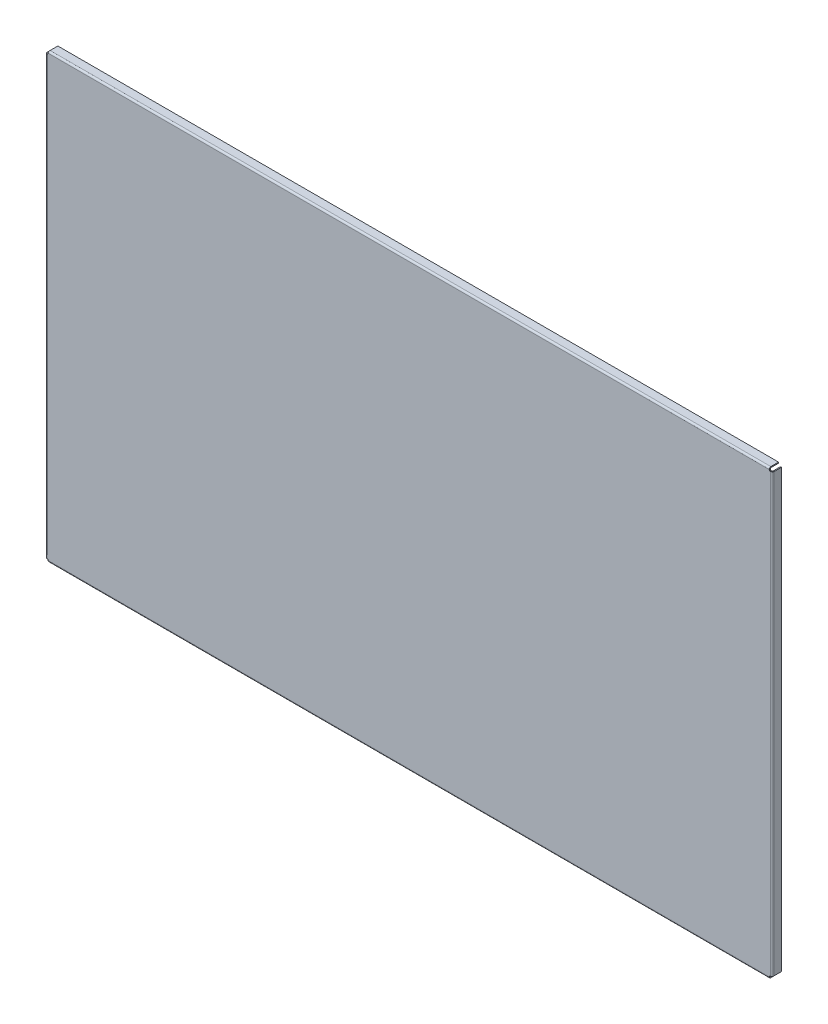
ISO-10303-21;
HEADER;
FILE_DESCRIPTION(('STEP AP214'),'2;1');
FILE_NAME('part.step','',(''),(''),'','','');
FILE_SCHEMA(('AUTOMOTIVE_DESIGN { 1 0 10303 214 1 1 1 1 }'));
ENDSEC;
DATA;
#1=APPLICATION_CONTEXT('core data for automotive mechanical design processes');
#2=APPLICATION_PROTOCOL_DEFINITION('international standard','automotive_design',2000,#1);
#3=PRODUCT_CONTEXT('',#1,'mechanical');
#4=PRODUCT('Part','Part','',(#3));
#5=PRODUCT_RELATED_PRODUCT_CATEGORY('part','',(#4));
#6=PRODUCT_DEFINITION_FORMATION('','',#4);
#7=PRODUCT_DEFINITION_CONTEXT('part definition',#1,'design');
#8=PRODUCT_DEFINITION('design','',#6,#7);
#9=PRODUCT_DEFINITION_SHAPE('','',#8);
#10=(LENGTH_UNIT() NAMED_UNIT(*) SI_UNIT(.MILLI.,.METRE.));
#11=(NAMED_UNIT(*) PLANE_ANGLE_UNIT() SI_UNIT($,.RADIAN.));
#12=(NAMED_UNIT(*) SI_UNIT($,.STERADIAN.) SOLID_ANGLE_UNIT());
#13=UNCERTAINTY_MEASURE_WITH_UNIT(LENGTH_MEASURE(1.E-05),#10,'distance_accuracy_value','');
#14=(GEOMETRIC_REPRESENTATION_CONTEXT(3) GLOBAL_UNCERTAINTY_ASSIGNED_CONTEXT((#13)) GLOBAL_UNIT_ASSIGNED_CONTEXT((#10,
#11,#12)) REPRESENTATION_CONTEXT('',''));
#15=CARTESIAN_POINT('',(0.,0.,0.));
#16=DIRECTION('',(0.,0.,1.));
#17=DIRECTION('',(1.,0.,0.));
#18=AXIS2_PLACEMENT_3D('',#15,#16,#17);
#19=CARTESIAN_POINT('',(0.,1.5,0.));
#20=DIRECTION('',(0.,-1.,0.));
#21=DIRECTION('',(0.,0.,-1.));
#22=AXIS2_PLACEMENT_3D('',#19,#20,#21);
#23=PLANE('',#22);
#24=DIRECTION('',(1.,0.,0.));
#25=VECTOR('',#24,1.);
#26=CARTESIAN_POINT('',(0.,1.5,4.5));
#27=LINE('',#26,#25);
#28=CARTESIAN_POINT('',(-535.585786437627,1.5,4.5));
#29=VERTEX_POINT('',#28);
#30=CARTESIAN_POINT('',(535.585786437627,1.5,4.5));
#31=VERTEX_POINT('',#30);
#32=EDGE_CURVE('E214',#29,#31,#27,.T.);
#33=ORIENTED_EDGE('',*,*,#32,.T.);
#34=DIRECTION('',(0.,0.,1.));
#35=VECTOR('',#34,1.);
#36=CARTESIAN_POINT('',(535.585786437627,1.5,0.));
#37=LINE('',#36,#35);
#38=CARTESIAN_POINT('',(535.585786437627,1.5,-7.));
#39=VERTEX_POINT('',#38);
#40=EDGE_CURVE('E352',#31,#39,#37,.F.);
#41=ORIENTED_EDGE('',*,*,#40,.T.);
#42=DIRECTION('',(1.,0.,0.));
#43=VECTOR('',#42,1.);
#44=CARTESIAN_POINT('',(0.,1.5,-7.));
#45=LINE('',#44,#43);
#46=CARTESIAN_POINT('',(-535.585786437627,1.5,-7.));
#47=VERTEX_POINT('',#46);
#48=EDGE_CURVE('E229',#39,#47,#45,.F.);
#49=ORIENTED_EDGE('',*,*,#48,.T.);
#50=DIRECTION('',(0.,0.,-1.));
#51=VECTOR('',#50,1.);
#52=CARTESIAN_POINT('',(-535.585786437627,1.5,0.));
#53=LINE('',#52,#51);
#54=EDGE_CURVE('E228',#47,#29,#53,.F.);
#55=ORIENTED_EDGE('',*,*,#54,.T.);
#56=EDGE_LOOP('',(#33,#41,#49,#55));
#57=FACE_BOUND('',#56,.T.);
#58=ADVANCED_FACE('F17',(#57),#23,.F.);
#59=CARTESIAN_POINT('',(-538.5,658.,7.));
#60=DIRECTION('',(1.,0.,0.));
#61=DIRECTION('',(0.,0.,-1.));
#62=AXIS2_PLACEMENT_3D('',#59,#60,#61);
#63=PLANE('',#62);
#64=DIRECTION('',(0.,0.,-1.));
#65=VECTOR('',#64,1.);
#66=CARTESIAN_POINT('',(-538.5,4.41421356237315,7.));
#67=LINE('',#66,#65);
#68=CARTESIAN_POINT('',(-538.5,4.41421356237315,-7.));
#69=VERTEX_POINT('',#68);
#70=CARTESIAN_POINT('',(-538.5,4.41421356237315,4.5));
#71=VERTEX_POINT('',#70);
#72=EDGE_CURVE('E342',#69,#71,#67,.F.);
#73=ORIENTED_EDGE('',*,*,#72,.F.);
#74=DIRECTION('',(0.,1.,0.));
#75=VECTOR('',#74,1.);
#76=CARTESIAN_POINT('',(-538.5,658.,-7.));
#77=LINE('',#76,#75);
#78=CARTESIAN_POINT('',(-538.5,653.585786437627,-7.));
#79=VERTEX_POINT('',#78);
#80=EDGE_CURVE('E337',#69,#79,#77,.T.);
#81=ORIENTED_EDGE('',*,*,#80,.T.);
#82=DIRECTION('',(0.,0.,1.));
#83=VECTOR('',#82,1.);
#84=CARTESIAN_POINT('',(-538.5,653.585786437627,5.5));
#85=LINE('',#84,#83);
#86=CARTESIAN_POINT('',(-538.5,653.585786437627,4.5));
#87=VERTEX_POINT('',#86);
#88=EDGE_CURVE('E322',#87,#79,#85,.F.);
#89=ORIENTED_EDGE('',*,*,#88,.F.);
#90=DIRECTION('',(0.,1.,0.));
#91=VECTOR('',#90,1.);
#92=CARTESIAN_POINT('',(-538.5,658.,4.5));
#93=LINE('',#92,#91);
#94=EDGE_CURVE('E319',#87,#71,#93,.F.);
#95=ORIENTED_EDGE('',*,*,#94,.T.);
#96=EDGE_LOOP('',(#73,#81,#89,#95));
#97=FACE_BOUND('',#96,.T.);
#98=ADVANCED_FACE('F624',(#97),#63,.T.);
#99=CARTESIAN_POINT('',(0.,656.5,0.));
#100=DIRECTION('',(0.,-1.,0.));
#101=DIRECTION('',(0.,0.,-1.));
#102=AXIS2_PLACEMENT_3D('',#99,#100,#101);
#103=PLANE('',#102);
#104=DIRECTION('',(0.,0.,1.));
#105=VECTOR('',#104,1.);
#106=CARTESIAN_POINT('',(-535.585786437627,656.5,-7.));
#107=LINE('',#106,#105);
#108=CARTESIAN_POINT('',(-535.585786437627,656.5,-7.));
#109=VERTEX_POINT('',#108);
#110=CARTESIAN_POINT('',(-535.585786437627,656.5,4.5));
#111=VERTEX_POINT('',#110);
#112=EDGE_CURVE('E305',#109,#111,#107,.T.);
#113=ORIENTED_EDGE('',*,*,#112,.F.);
#114=DIRECTION('',(1.,0.,0.));
#115=VECTOR('',#114,1.);
#116=CARTESIAN_POINT('',(0.,656.5,-7.));
#117=LINE('',#116,#115);
#118=CARTESIAN_POINT('',(535.585786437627,656.5,-7.));
#119=VERTEX_POINT('',#118);
#120=EDGE_CURVE('E299',#109,#119,#117,.T.);
#121=ORIENTED_EDGE('',*,*,#120,.T.);
#122=DIRECTION('',(0.,0.,-1.));
#123=VECTOR('',#122,1.);
#124=CARTESIAN_POINT('',(535.585786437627,656.5,5.5));
#125=LINE('',#124,#123);
#126=CARTESIAN_POINT('',(535.585786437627,656.5,4.5));
#127=VERTEX_POINT('',#126);
#128=EDGE_CURVE('E278',#127,#119,#125,.T.);
#129=ORIENTED_EDGE('',*,*,#128,.F.);
#130=DIRECTION('',(-1.,0.,0.));
#131=VECTOR('',#130,1.);
#132=CARTESIAN_POINT('',(-540.,656.5,4.5));
#133=LINE('',#132,#131);
#134=EDGE_CURVE('E302',#127,#111,#133,.T.);
#135=ORIENTED_EDGE('',*,*,#134,.T.);
#136=EDGE_LOOP('',(#113,#121,#129,#135));
#137=FACE_BOUND('',#136,.T.);
#138=ADVANCED_FACE('F627',(#137),#103,.T.);
#139=CARTESIAN_POINT('',(-540.,658.,5.5));
#140=DIRECTION('',(0.,0.,-1.));
#141=DIRECTION('',(-1.,0.,0.));
#142=AXIS2_PLACEMENT_3D('',#139,#140,#141);
#143=PLANE('',#142);
#144=DIRECTION('',(0.,1.,0.));
#145=VECTOR('',#144,1.);
#146=CARTESIAN_POINT('',(537.5,658.,5.5));
#147=LINE('',#146,#145);
#148=CARTESIAN_POINT('',(537.5,654.,5.5));
#149=VERTEX_POINT('',#148);
#150=CARTESIAN_POINT('',(537.5,4.,5.5));
#151=VERTEX_POINT('',#150);
#152=EDGE_CURVE('E276',#149,#151,#147,.F.);
#153=ORIENTED_EDGE('',*,*,#152,.T.);
#154=DIRECTION('',(-1.,0.,0.));
#155=VECTOR('',#154,1.);
#156=CARTESIAN_POINT('',(-540.,4.,5.5));
#157=LINE('',#156,#155);
#158=CARTESIAN_POINT('',(536.,4.,5.5));
#159=VERTEX_POINT('',#158);
#160=EDGE_CURVE('E234',#151,#159,#157,.T.);
#161=ORIENTED_EDGE('',*,*,#160,.T.);
#162=DIRECTION('',(0.,1.,0.));
#163=VECTOR('',#162,1.);
#164=CARTESIAN_POINT('',(536.,658.,5.5));
#165=LINE('',#164,#163);
#166=CARTESIAN_POINT('',(536.,2.49999999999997,5.5));
#167=VERTEX_POINT('',#166);
#168=EDGE_CURVE('E402',#159,#167,#165,.F.);
#169=ORIENTED_EDGE('',*,*,#168,.T.);
#170=DIRECTION('',(1.,0.,0.));
#171=VECTOR('',#170,1.);
#172=CARTESIAN_POINT('',(0.,2.49999999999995,5.5));
#173=LINE('',#172,#171);
#174=CARTESIAN_POINT('',(-536.,2.49999999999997,5.5));
#175=VERTEX_POINT('',#174);
#176=EDGE_CURVE('E224',#167,#175,#173,.F.);
#177=ORIENTED_EDGE('',*,*,#176,.T.);
#178=DIRECTION('',(0.,1.,0.));
#179=VECTOR('',#178,1.);
#180=CARTESIAN_POINT('',(-536.,658.,5.5));
#181=LINE('',#180,#179);
#182=CARTESIAN_POINT('',(-536.,4.,5.5));
#183=VERTEX_POINT('',#182);
#184=EDGE_CURVE('E207',#175,#183,#181,.T.);
#185=ORIENTED_EDGE('',*,*,#184,.T.);
#186=DIRECTION('',(-1.,0.,0.));
#187=VECTOR('',#186,1.);
#188=CARTESIAN_POINT('',(-540.,4.,5.5));
#189=LINE('',#188,#187);
#190=CARTESIAN_POINT('',(-537.5,4.,5.5));
#191=VERTEX_POINT('',#190);
#192=EDGE_CURVE('E389',#183,#191,#189,.T.);
#193=ORIENTED_EDGE('',*,*,#192,.T.);
#194=DIRECTION('',(0.,1.,0.));
#195=VECTOR('',#194,1.);
#196=CARTESIAN_POINT('',(-537.5,658.,5.5));
#197=LINE('',#196,#195);
#198=CARTESIAN_POINT('',(-537.5,654.,5.5));
#199=VERTEX_POINT('',#198);
#200=EDGE_CURVE('E309',#191,#199,#197,.T.);
#201=ORIENTED_EDGE('',*,*,#200,.T.);
#202=DIRECTION('',(-1.,0.,0.));
#203=VECTOR('',#202,1.);
#204=CARTESIAN_POINT('',(-540.,654.,5.5));
#205=LINE('',#204,#203);
#206=CARTESIAN_POINT('',(-536.,654.,5.5));
#207=VERTEX_POINT('',#206);
#208=EDGE_CURVE('E383',#199,#207,#205,.F.);
#209=ORIENTED_EDGE('',*,*,#208,.T.);
#210=DIRECTION('',(0.,1.,0.));
#211=VECTOR('',#210,1.);
#212=CARTESIAN_POINT('',(-536.,658.,5.5));
#213=LINE('',#212,#211);
#214=CARTESIAN_POINT('',(-536.,655.5,5.5));
#215=VERTEX_POINT('',#214);
#216=EDGE_CURVE('E381',#207,#215,#213,.T.);
#217=ORIENTED_EDGE('',*,*,#216,.T.);
#218=DIRECTION('',(-1.,0.,0.));
#219=VECTOR('',#218,1.);
#220=CARTESIAN_POINT('',(-540.,655.5,5.5));
#221=LINE('',#220,#219);
#222=CARTESIAN_POINT('',(536.,655.5,5.5));
#223=VERTEX_POINT('',#222);
#224=EDGE_CURVE('E306',#215,#223,#221,.F.);
#225=ORIENTED_EDGE('',*,*,#224,.T.);
#226=DIRECTION('',(0.,1.,0.));
#227=VECTOR('',#226,1.);
#228=CARTESIAN_POINT('',(536.,658.,5.5));
#229=LINE('',#228,#227);
#230=CARTESIAN_POINT('',(536.,654.,5.5));
#231=VERTEX_POINT('',#230);
#232=EDGE_CURVE('E372',#223,#231,#229,.F.);
#233=ORIENTED_EDGE('',*,*,#232,.T.);
#234=DIRECTION('',(-1.,0.,0.));
#235=VECTOR('',#234,1.);
#236=CARTESIAN_POINT('',(-540.,654.,5.5));
#237=LINE('',#236,#235);
#238=EDGE_CURVE('E370',#231,#149,#237,.F.);
#239=ORIENTED_EDGE('',*,*,#238,.T.);
#240=EDGE_LOOP('',(#153,#161,#169,#177,#185,#193,#201,#209,#217,#225,#233,#239));
#241=FACE_BOUND('',#240,.T.);
#242=ADVANCED_FACE('F631',(#241),#143,.T.);
#243=CARTESIAN_POINT('',(538.5,658.,7.));
#244=DIRECTION('',(-1.,0.,0.));
#245=DIRECTION('',(0.,0.,1.));
#246=AXIS2_PLACEMENT_3D('',#243,#244,#245);
#247=PLANE('',#246);
#248=DIRECTION('',(0.,0.,1.));
#249=VECTOR('',#248,1.);
#250=CARTESIAN_POINT('',(538.5,653.585786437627,-7.));
#251=LINE('',#250,#249);
#252=CARTESIAN_POINT('',(538.5,653.585786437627,-7.));
#253=VERTEX_POINT('',#252);
#254=CARTESIAN_POINT('',(538.5,653.585786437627,4.5));
#255=VERTEX_POINT('',#254);
#256=EDGE_CURVE('E270',#253,#255,#251,.T.);
#257=ORIENTED_EDGE('',*,*,#256,.F.);
#258=DIRECTION('',(0.,1.,0.));
#259=VECTOR('',#258,1.);
#260=CARTESIAN_POINT('',(538.5,658.,-7.));
#261=LINE('',#260,#259);
#262=CARTESIAN_POINT('',(538.5,4.41421356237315,-7.));
#263=VERTEX_POINT('',#262);
#264=EDGE_CURVE('E258',#263,#253,#261,.T.);
#265=ORIENTED_EDGE('',*,*,#264,.F.);
#266=DIRECTION('',(0.,0.,-1.));
#267=VECTOR('',#266,1.);
#268=CARTESIAN_POINT('',(538.5,4.41421356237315,7.));
#269=LINE('',#268,#267);
#270=CARTESIAN_POINT('',(538.5,4.41421356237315,4.5));
#271=VERTEX_POINT('',#270);
#272=EDGE_CURVE('E247',#271,#263,#269,.T.);
#273=ORIENTED_EDGE('',*,*,#272,.F.);
#274=DIRECTION('',(0.,1.,0.));
#275=VECTOR('',#274,1.);
#276=CARTESIAN_POINT('',(538.5,658.,4.5));
#277=LINE('',#276,#275);
#278=EDGE_CURVE('E273',#271,#255,#277,.T.);
#279=ORIENTED_EDGE('',*,*,#278,.T.);
#280=EDGE_LOOP('',(#257,#265,#273,#279));
#281=FACE_BOUND('',#280,.T.);
#282=ADVANCED_FACE('F635',(#281),#247,.T.);
#283=CARTESIAN_POINT('',(-535.585786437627,1.5,0.));
#284=DIRECTION('',(1.,0.,0.));
#285=DIRECTION('',(0.,0.,-1.));
#286=AXIS2_PLACEMENT_3D('',#283,#284,#285);
#287=PLANE('',#286);
#288=DIRECTION('',(0.,0.,-1.));
#289=VECTOR('',#288,1.);
#290=CARTESIAN_POINT('',(-535.585786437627,0.,0.));
#291=LINE('',#290,#289);
#292=CARTESIAN_POINT('',(-535.585786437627,0.,4.5));
#293=VERTEX_POINT('',#292);
#294=CARTESIAN_POINT('',(-535.585786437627,0.,-7.));
#295=VERTEX_POINT('',#294);
#296=EDGE_CURVE('E243',#293,#295,#291,.T.);
#297=ORIENTED_EDGE('',*,*,#296,.F.);
#298=DIRECTION('',(0.,-1.,0.));
#299=VECTOR('',#298,1.);
#300=CARTESIAN_POINT('',(-535.585786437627,0.75,4.5));
#301=LINE('',#300,#299);
#302=EDGE_CURVE('E239',#29,#293,#301,.T.);
#303=ORIENTED_EDGE('',*,*,#302,.F.);
#304=ORIENTED_EDGE('',*,*,#54,.F.);
#305=DIRECTION('',(0.,1.,0.));
#306=VECTOR('',#305,1.);
#307=CARTESIAN_POINT('',(-535.585786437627,1.5,-7.));
#308=LINE('',#307,#306);
#309=EDGE_CURVE('E360',#47,#295,#308,.F.);
#310=ORIENTED_EDGE('',*,*,#309,.T.);
#311=EDGE_LOOP('',(#297,#303,#304,#310));
#312=FACE_BOUND('',#311,.T.);
#313=ADVANCED_FACE('F245',(#312),#287,.F.);
#314=CARTESIAN_POINT('',(0.,1.5,-7.));
#315=DIRECTION('',(0.,0.,1.));
#316=DIRECTION('',(1.,0.,0.));
#317=AXIS2_PLACEMENT_3D('',#314,#315,#316);
#318=PLANE('',#317);
#319=DIRECTION('',(1.,0.,0.));
#320=VECTOR('',#319,1.);
#321=CARTESIAN_POINT('',(0.,0.,-7.));
#322=LINE('',#321,#320);
#323=CARTESIAN_POINT('',(535.585786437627,0.,-7.));
#324=VERTEX_POINT('',#323);
#325=EDGE_CURVE('E355',#295,#324,#322,.T.);
#326=ORIENTED_EDGE('',*,*,#325,.F.);
#327=ORIENTED_EDGE('',*,*,#309,.F.);
#328=ORIENTED_EDGE('',*,*,#48,.F.);
#329=DIRECTION('',(0.,1.,0.));
#330=VECTOR('',#329,1.);
#331=CARTESIAN_POINT('',(535.585786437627,1.5,-7.));
#332=LINE('',#331,#330);
#333=EDGE_CURVE('E349',#39,#324,#332,.F.);
#334=ORIENTED_EDGE('',*,*,#333,.T.);
#335=EDGE_LOOP('',(#326,#327,#328,#334));
#336=FACE_BOUND('',#335,.T.);
#337=ADVANCED_FACE('F642',(#336),#318,.F.);
#338=CARTESIAN_POINT('',(535.585786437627,1.5,0.));
#339=DIRECTION('',(-1.,0.,0.));
#340=DIRECTION('',(0.,0.,1.));
#341=AXIS2_PLACEMENT_3D('',#338,#339,#340);
#342=PLANE('',#341);
#343=DIRECTION('',(0.,0.,-1.));
#344=VECTOR('',#343,1.);
#345=CARTESIAN_POINT('',(535.585786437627,0.,0.));
#346=LINE('',#345,#344);
#347=CARTESIAN_POINT('',(535.585786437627,0.,4.5));
#348=VERTEX_POINT('',#347);
#349=EDGE_CURVE('E357',#324,#348,#346,.F.);
#350=ORIENTED_EDGE('',*,*,#349,.F.);
#351=ORIENTED_EDGE('',*,*,#333,.F.);
#352=ORIENTED_EDGE('',*,*,#40,.F.);
#353=DIRECTION('',(0.,1.,0.));
#354=VECTOR('',#353,1.);
#355=CARTESIAN_POINT('',(535.585786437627,1.5,4.5));
#356=LINE('',#355,#354);
#357=EDGE_CURVE('E225',#348,#31,#356,.T.);
#358=ORIENTED_EDGE('',*,*,#357,.F.);
#359=EDGE_LOOP('',(#350,#351,#352,#358));
#360=FACE_BOUND('',#359,.T.);
#361=ADVANCED_FACE('F645',(#360),#342,.F.);
#362=CARTESIAN_POINT('',(0.,2.5,4.5));
#363=DIRECTION('',(1.,0.,0.));
#364=DIRECTION('',(0.,0.,-1.));
#365=AXIS2_PLACEMENT_3D('',#362,#363,#364);
#366=CYLINDRICAL_SURFACE('',#365,1.);
#367=ORIENTED_EDGE('',*,*,#176,.F.);
#368=CARTESIAN_POINT('',(535.585786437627,1.5,4.5));
#369=CARTESIAN_POINT('',(535.585791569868,1.49999628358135,4.52396943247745));
#370=CARTESIAN_POINT('',(535.586773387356,1.50086202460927,4.54790535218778));
#371=CARTESIAN_POINT('',(535.590400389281,1.5042849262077,4.59548683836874));
#372=CARTESIAN_POINT('',(535.593042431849,1.50683889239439,4.61913286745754));
#373=CARTESIAN_POINT('',(535.602973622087,1.51690809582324,4.68902809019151));
#374=CARTESIAN_POINT('',(535.612278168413,1.52683242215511,4.73465915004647));
#375=CARTESIAN_POINT('',(535.634406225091,1.55245977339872,4.82290837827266));
#376=CARTESIAN_POINT('',(535.647204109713,1.56812099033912,4.86554574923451));
#377=CARTESIAN_POINT('',(535.675097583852,1.60472845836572,4.94779358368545));
#378=CARTESIAN_POINT('',(535.690198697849,1.62568749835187,4.98739641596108));
#379=CARTESIAN_POINT('',(535.724891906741,1.67708899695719,5.07067351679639));
#380=CARTESIAN_POINT('',(535.744777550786,1.7085902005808,5.11357339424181));
#381=CARTESIAN_POINT('',(535.785118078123,1.77781181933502,5.19372196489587));
#382=CARTESIAN_POINT('',(535.805573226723,1.81553517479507,5.23096797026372));
#383=CARTESIAN_POINT('',(535.848385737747,1.90177399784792,5.30355152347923));
#384=CARTESIAN_POINT('',(535.870653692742,1.95105201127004,5.33804227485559));
#385=CARTESIAN_POINT('',(535.912397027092,2.05594692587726,5.39803056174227));
#386=CARTESIAN_POINT('',(535.931873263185,2.11156187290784,5.42353085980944));
#387=CARTESIAN_POINT('',(535.960415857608,2.21091169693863,5.45829782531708));
#388=CARTESIAN_POINT('',(535.970860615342,2.25335960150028,5.47013135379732));
#389=CARTESIAN_POINT('',(535.987595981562,2.34014417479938,5.48812321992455));
#390=CARTESIAN_POINT('',(535.993903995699,2.38447208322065,5.49430537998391));
#391=CARTESIAN_POINT('',(535.999036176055,2.45272027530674,5.4991654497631));
#392=CARTESIAN_POINT('',(535.999990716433,2.47635018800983,5.50001170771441));
#393=CARTESIAN_POINT('',(536.,2.5,5.5));
#394=B_SPLINE_CURVE_WITH_KNOTS('',3,(#368,#369,#370,#371,#372,#373,#374,#375,#376,#377,#378,
#379,#380,#381,#382,#383,#384,#385,#386,#387,#388,#389,#390,#391,#392,#393),.UNSPECIFIED.,.F.,
.F.,(4,2,2,2,2,2,2,2,2,2,2,2,4),(0.,0.0718194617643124,0.143503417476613,0.285617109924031,
0.426715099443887,0.568157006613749,0.737942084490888,0.907807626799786,1.0993010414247,
1.29073556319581,1.42614133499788,1.56097365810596,1.63186947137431),.UNSPECIFIED.);
#395=EDGE_CURVE('E220',#31,#167,#394,.T.);
#396=ORIENTED_EDGE('',*,*,#395,.F.);
#397=ORIENTED_EDGE('',*,*,#32,.F.);
#398=CARTESIAN_POINT('',(-536.,2.5,5.5));
#399=CARTESIAN_POINT('',(-535.999994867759,2.47603056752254,5.50000371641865));
#400=CARTESIAN_POINT('',(-535.999013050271,2.45209464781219,5.49913797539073));
#401=CARTESIAN_POINT('',(-535.995386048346,2.40451316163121,5.4957150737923));
#402=CARTESIAN_POINT('',(-535.992744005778,2.38086713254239,5.4931611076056));
#403=CARTESIAN_POINT('',(-535.98281281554,2.31097190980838,5.48309190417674));
#404=CARTESIAN_POINT('',(-535.973508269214,2.26534084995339,5.47316757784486));
#405=CARTESIAN_POINT('',(-535.951380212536,2.17709162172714,5.44754022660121));
#406=CARTESIAN_POINT('',(-535.938582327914,2.13445425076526,5.43187900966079));
#407=CARTESIAN_POINT('',(-535.910688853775,2.05220641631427,5.39527154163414));
#408=CARTESIAN_POINT('',(-535.895587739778,2.01260358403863,5.37431250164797));
#409=CARTESIAN_POINT('',(-535.860894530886,1.92932648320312,5.32291100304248));
#410=CARTESIAN_POINT('',(-535.841008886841,1.88642660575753,5.29140979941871));
#411=CARTESIAN_POINT('',(-535.800668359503,1.80627803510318,5.2221881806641));
#412=CARTESIAN_POINT('',(-535.780213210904,1.76903202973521,5.1844648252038));
#413=CARTESIAN_POINT('',(-535.737400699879,1.69644847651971,5.09822600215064));
#414=CARTESIAN_POINT('',(-535.715132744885,1.66195772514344,5.04894798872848));
#415=CARTESIAN_POINT('',(-535.673389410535,1.60196943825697,4.94405307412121));
#416=CARTESIAN_POINT('',(-535.653913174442,1.57646914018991,4.88843812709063));
#417=CARTESIAN_POINT('',(-535.625370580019,1.54170217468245,4.78908830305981));
#418=CARTESIAN_POINT('',(-535.614925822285,1.52986864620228,4.74664039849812));
#419=CARTESIAN_POINT('',(-535.598190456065,1.51187678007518,4.65985582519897));
#420=CARTESIAN_POINT('',(-535.591882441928,1.5056946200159,4.61552791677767));
#421=CARTESIAN_POINT('',(-535.586750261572,1.50083455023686,4.54727972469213));
#422=CARTESIAN_POINT('',(-535.585795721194,1.49998829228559,4.52364981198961));
#423=CARTESIAN_POINT('',(-535.585786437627,1.5,4.5));
#424=B_SPLINE_CURVE_WITH_KNOTS('',3,(#398,#399,#400,#401,#402,#403,#404,#405,#406,#407,#408,
#409,#410,#411,#412,#413,#414,#415,#416,#417,#418,#419,#420,#421,#422,#423),.UNSPECIFIED.,.F.,
.F.,(4,2,2,2,2,2,2,2,2,2,2,2,4),(0.,0.0718194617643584,0.143503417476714,0.285617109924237,
0.426715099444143,0.568157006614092,0.737942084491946,0.90780762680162,1.09930104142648,
1.29073556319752,1.42614133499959,1.56097365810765,1.63186947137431),.UNSPECIFIED.);
#425=EDGE_CURVE('E24',#175,#29,#424,.T.);
#426=ORIENTED_EDGE('',*,*,#425,.F.);
#427=EDGE_LOOP('',(#367,#396,#397,#426));
#428=FACE_BOUND('',#427,.T.);
#429=ADVANCED_FACE('F217',(#428),#366,.F.);
#430=CARTESIAN_POINT('',(-538.5,4.41421356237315,7.));
#431=DIRECTION('',(0.,-1.,0.));
#432=DIRECTION('',(0.,0.,-1.));
#433=AXIS2_PLACEMENT_3D('',#430,#431,#432);
#434=PLANE('',#433);
#435=DIRECTION('',(1.,0.,0.));
#436=VECTOR('',#435,1.);
#437=CARTESIAN_POINT('',(-538.5,4.41421356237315,-7.));
#438=LINE('',#437,#436);
#439=CARTESIAN_POINT('',(-540.,4.41421356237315,-7.));
#440=VERTEX_POINT('',#439);
#441=EDGE_CURVE('E325',#440,#69,#438,.T.);
#442=ORIENTED_EDGE('',*,*,#441,.T.);
#443=ORIENTED_EDGE('',*,*,#72,.T.);
#444=DIRECTION('',(1.,0.,0.));
#445=VECTOR('',#444,1.);
#446=CARTESIAN_POINT('',(-538.5,4.41421356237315,4.5));
#447=LINE('',#446,#445);
#448=CARTESIAN_POINT('',(-540.,4.41421356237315,4.5));
#449=VERTEX_POINT('',#448);
#450=EDGE_CURVE('E340',#71,#449,#447,.F.);
#451=ORIENTED_EDGE('',*,*,#450,.T.);
#452=DIRECTION('',(0.,0.,-1.));
#453=VECTOR('',#452,1.);
#454=CARTESIAN_POINT('',(-540.,4.41421356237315,7.));
#455=LINE('',#454,#453);
#456=EDGE_CURVE('E332',#449,#440,#455,.T.);
#457=ORIENTED_EDGE('',*,*,#456,.T.);
#458=EDGE_LOOP('',(#442,#443,#451,#457));
#459=FACE_BOUND('',#458,.T.);
#460=ADVANCED_FACE('F652',(#459),#434,.T.);
#461=CARTESIAN_POINT('',(-538.5,658.,-7.));
#462=DIRECTION('',(0.,0.,1.));
#463=DIRECTION('',(1.,0.,0.));
#464=AXIS2_PLACEMENT_3D('',#461,#462,#463);
#465=PLANE('',#464);
#466=DIRECTION('',(0.,1.,0.));
#467=VECTOR('',#466,1.);
#468=CARTESIAN_POINT('',(-540.,658.,-7.));
#469=LINE('',#468,#467);
#470=CARTESIAN_POINT('',(-540.,653.585786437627,-7.));
#471=VERTEX_POINT('',#470);
#472=EDGE_CURVE('E328',#440,#471,#469,.T.);
#473=ORIENTED_EDGE('',*,*,#472,.T.);
#474=DIRECTION('',(1.,0.,0.));
#475=VECTOR('',#474,1.);
#476=CARTESIAN_POINT('',(-538.5,653.585786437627,-7.));
#477=LINE('',#476,#475);
#478=EDGE_CURVE('E323',#79,#471,#477,.F.);
#479=ORIENTED_EDGE('',*,*,#478,.F.);
#480=ORIENTED_EDGE('',*,*,#80,.F.);
#481=ORIENTED_EDGE('',*,*,#441,.F.);
#482=EDGE_LOOP('',(#473,#479,#480,#481));
#483=FACE_BOUND('',#482,.T.);
#484=ADVANCED_FACE('F655',(#483),#465,.F.);
#485=CARTESIAN_POINT('',(-538.5,653.585786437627,5.5));
#486=DIRECTION('',(0.,1.,0.));
#487=DIRECTION('',(0.,0.,1.));
#488=AXIS2_PLACEMENT_3D('',#485,#486,#487);
#489=PLANE('',#488);
#490=DIRECTION('',(-1.,0.,0.));
#491=VECTOR('',#490,1.);
#492=CARTESIAN_POINT('',(-539.25,653.585786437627,4.5));
#493=LINE('',#492,#491);
#494=CARTESIAN_POINT('',(-540.,653.585786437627,4.5));
#495=VERTEX_POINT('',#494);
#496=EDGE_CURVE('E791',#87,#495,#493,.T.);
#497=ORIENTED_EDGE('',*,*,#496,.F.);
#498=ORIENTED_EDGE('',*,*,#88,.T.);
#499=ORIENTED_EDGE('',*,*,#478,.T.);
#500=DIRECTION('',(0.,0.,-1.));
#501=VECTOR('',#500,1.);
#502=CARTESIAN_POINT('',(-540.,653.585786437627,7.));
#503=LINE('',#502,#501);
#504=EDGE_CURVE('E331',#471,#495,#503,.F.);
#505=ORIENTED_EDGE('',*,*,#504,.T.);
#506=EDGE_LOOP('',(#497,#498,#499,#505));
#507=FACE_BOUND('',#506,.T.);
#508=ADVANCED_FACE('F532',(#507),#489,.T.);
#509=CARTESIAN_POINT('',(-537.5,658.,4.5));
#510=DIRECTION('',(0.,1.,0.));
#511=DIRECTION('',(0.,0.,1.));
#512=AXIS2_PLACEMENT_3D('',#509,#510,#511);
#513=CYLINDRICAL_SURFACE('',#512,1.);
#514=ORIENTED_EDGE('',*,*,#200,.F.);
#515=CARTESIAN_POINT('',(-538.5,4.41421356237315,4.5));
#516=CARTESIAN_POINT('',(-538.500003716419,4.41420843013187,4.52396943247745));
#517=CARTESIAN_POINT('',(-538.499137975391,4.41322661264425,4.54790535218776));
#518=CARTESIAN_POINT('',(-538.495715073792,4.4095996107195,4.59548683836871));
#519=CARTESIAN_POINT('',(-538.493161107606,4.40695756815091,4.61913286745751));
#520=CARTESIAN_POINT('',(-538.483091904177,4.39702637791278,4.68902809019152));
#521=CARTESIAN_POINT('',(-538.473167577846,4.38772183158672,4.73465915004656));
#522=CARTESIAN_POINT('',(-538.447540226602,4.36559377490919,4.8229083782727));
#523=CARTESIAN_POINT('',(-538.431879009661,4.35279589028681,4.86554574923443));
#524=CARTESIAN_POINT('',(-538.395271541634,4.32490241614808,4.94779358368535));
#525=CARTESIAN_POINT('',(-538.374312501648,4.30980130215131,4.98739641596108));
#526=CARTESIAN_POINT('',(-538.322911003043,4.27510809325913,5.0706735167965));
#527=CARTESIAN_POINT('',(-538.291409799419,4.2552224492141,5.11357339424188));
#528=CARTESIAN_POINT('',(-538.222188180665,4.2148819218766,5.19372196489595));
#529=CARTESIAN_POINT('',(-538.184464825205,4.19442677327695,5.23096797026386));
#530=CARTESIAN_POINT('',(-538.098226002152,4.15161426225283,5.30355152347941));
#531=CARTESIAN_POINT('',(-538.04894798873,4.12934630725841,5.33804227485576));
#532=CARTESIAN_POINT('',(-537.944053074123,4.08760297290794,5.39803056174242));
#533=CARTESIAN_POINT('',(-537.888438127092,4.06812673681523,5.42353085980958));
#534=CARTESIAN_POINT('',(-537.789088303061,4.03958414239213,5.45829782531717));
#535=CARTESIAN_POINT('',(-537.746640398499,4.02913938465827,5.47013135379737));
#536=CARTESIAN_POINT('',(-537.6598558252,4.01240401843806,5.48812321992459));
#537=CARTESIAN_POINT('',(-537.615527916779,4.00609600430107,5.49430537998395));
#538=CARTESIAN_POINT('',(-537.547279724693,4.00096382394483,5.49916544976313));
#539=CARTESIAN_POINT('',(-537.52364981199,4.00000928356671,5.50001170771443));
#540=CARTESIAN_POINT('',(-537.5,4.,5.5));
#541=B_SPLINE_CURVE_WITH_KNOTS('',3,(#515,#516,#517,#518,#519,#520,#521,#522,#523,#524,#525,
#526,#527,#528,#529,#530,#531,#532,#533,#534,#535,#536,#537,#538,#539,#540),.UNSPECIFIED.,.F.,
.F.,(4,2,2,2,2,2,2,2,2,2,2,2,4),(0.,0.071819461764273,0.143503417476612,0.28561710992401,
0.426715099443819,0.568157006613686,0.737942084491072,0.907807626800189,1.09930104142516,
1.29073556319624,1.42614133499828,1.56097365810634,1.63186947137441),.UNSPECIFIED.);
#542=EDGE_CURVE('E514',#71,#191,#541,.T.);
#543=ORIENTED_EDGE('',*,*,#542,.F.);
#544=ORIENTED_EDGE('',*,*,#94,.F.);
#545=CARTESIAN_POINT('',(-537.5,654.,5.5));
#546=CARTESIAN_POINT('',(-537.523969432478,653.999994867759,5.50000371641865));
#547=CARTESIAN_POINT('',(-537.547905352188,653.999013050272,5.49913797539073));
#548=CARTESIAN_POINT('',(-537.595486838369,653.995386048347,5.4957150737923));
#549=CARTESIAN_POINT('',(-537.619132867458,653.992744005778,5.4931611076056));
#550=CARTESIAN_POINT('',(-537.689028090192,653.98281281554,5.48309190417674));
#551=CARTESIAN_POINT('',(-537.734659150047,653.973508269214,5.47316757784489));
#552=CARTESIAN_POINT('',(-537.822908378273,653.951380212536,5.44754022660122));
#553=CARTESIAN_POINT('',(-537.865545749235,653.938582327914,5.43187900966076));
#554=CARTESIAN_POINT('',(-537.947793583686,653.910688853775,5.39527154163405));
#555=CARTESIAN_POINT('',(-537.987396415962,653.895587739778,5.37431250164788));
#556=CARTESIAN_POINT('',(-538.070673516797,653.860894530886,5.32291100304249));
#557=CARTESIAN_POINT('',(-538.113573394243,653.841008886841,5.29140979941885));
#558=CARTESIAN_POINT('',(-538.193721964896,653.800668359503,5.22218818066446));
#559=CARTESIAN_POINT('',(-538.230967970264,653.780213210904,5.18446482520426));
#560=CARTESIAN_POINT('',(-538.30355152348,653.73740069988,5.09822600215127));
#561=CARTESIAN_POINT('',(-538.338042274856,653.715132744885,5.04894798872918));
#562=CARTESIAN_POINT('',(-538.398030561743,653.673389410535,4.94405307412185));
#563=CARTESIAN_POINT('',(-538.42353085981,653.653913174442,4.88843812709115));
#564=CARTESIAN_POINT('',(-538.458297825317,653.625370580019,4.78908830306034));
#565=CARTESIAN_POINT('',(-538.470131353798,653.614925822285,4.74664039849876));
#566=CARTESIAN_POINT('',(-538.488123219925,653.598190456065,4.65985582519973));
#567=CARTESIAN_POINT('',(-538.494305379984,653.591882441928,4.61552791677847));
#568=CARTESIAN_POINT('',(-538.499165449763,653.586750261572,4.54727972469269));
#569=CARTESIAN_POINT('',(-538.500011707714,653.585795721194,4.52364981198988));
#570=CARTESIAN_POINT('',(-538.5,653.585786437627,4.5));
#571=B_SPLINE_CURVE_WITH_KNOTS('',3,(#545,#546,#547,#548,#549,#550,#551,#552,#553,#554,#555,
#556,#557,#558,#559,#560,#561,#562,#563,#564,#565,#566,#567,#568,#569,#570),.UNSPECIFIED.,.F.,
.F.,(4,2,2,2,2,2,2,2,2,2,2,2,4),(0.,0.0718194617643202,0.143503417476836,0.285617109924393,
0.426715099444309,0.568157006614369,0.737942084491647,0.907807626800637,1.09930104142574,
1.29073556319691,1.42614133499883,1.56097365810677,1.63186947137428),.UNSPECIFIED.);
#572=EDGE_CURVE('E536',#199,#87,#571,.T.);
#573=ORIENTED_EDGE('',*,*,#572,.F.);
#574=EDGE_LOOP('',(#514,#543,#544,#573));
#575=FACE_BOUND('',#574,.T.);
#576=ADVANCED_FACE('F525',(#575),#513,.F.);
#577=CARTESIAN_POINT('',(-540.,655.5,4.5));
#578=DIRECTION('',(-1.,0.,0.));
#579=DIRECTION('',(0.,0.,1.));
#580=AXIS2_PLACEMENT_3D('',#577,#578,#579);
#581=CYLINDRICAL_SURFACE('',#580,1.);
#582=ORIENTED_EDGE('',*,*,#134,.F.);
#583=CARTESIAN_POINT('',(536.,655.5,5.5));
#584=CARTESIAN_POINT('',(535.999994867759,655.523969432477,5.50000371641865));
#585=CARTESIAN_POINT('',(535.999013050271,655.547905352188,5.49913797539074));
#586=CARTESIAN_POINT('',(535.995386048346,655.595486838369,5.4957150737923));
#587=CARTESIAN_POINT('',(535.992744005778,655.619132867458,5.4931611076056));
#588=CARTESIAN_POINT('',(535.98281281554,655.689028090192,5.48309190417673));
#589=CARTESIAN_POINT('',(535.973508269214,655.734659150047,5.47316757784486));
#590=CARTESIAN_POINT('',(535.951380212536,655.822908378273,5.44754022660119));
#591=CARTESIAN_POINT('',(535.938582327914,655.865545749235,5.43187900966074));
#592=CARTESIAN_POINT('',(535.910688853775,655.947793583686,5.39527154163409));
#593=CARTESIAN_POINT('',(535.895587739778,655.987396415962,5.37431250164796));
#594=CARTESIAN_POINT('',(535.860894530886,656.070673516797,5.32291100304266));
#595=CARTESIAN_POINT('',(535.841008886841,656.113573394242,5.29140979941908));
#596=CARTESIAN_POINT('',(535.800668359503,656.193721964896,5.22218818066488));
#597=CARTESIAN_POINT('',(535.780213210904,656.230967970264,5.18446482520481));
#598=CARTESIAN_POINT('',(535.73740069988,656.303551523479,5.09822600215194));
#599=CARTESIAN_POINT('',(535.715132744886,656.338042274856,5.04894798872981));
#600=CARTESIAN_POINT('',(535.673389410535,656.398030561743,4.94405307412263));
#601=CARTESIAN_POINT('',(535.653913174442,656.42353085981,4.88843812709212));
#602=CARTESIAN_POINT('',(535.625370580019,656.458297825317,4.78908830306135));
#603=CARTESIAN_POINT('',(535.614925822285,656.470131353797,4.7466403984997));
#604=CARTESIAN_POINT('',(535.598190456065,656.488123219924,4.65985582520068));
#605=CARTESIAN_POINT('',(535.591882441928,656.494305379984,4.61552791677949));
#606=CARTESIAN_POINT('',(535.586750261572,656.499165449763,4.54727972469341));
#607=CARTESIAN_POINT('',(535.585795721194,656.500011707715,4.52364981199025));
#608=CARTESIAN_POINT('',(535.585786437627,656.5,4.5));
#609=B_SPLINE_CURVE_WITH_KNOTS('',3,(#583,#584,#585,#586,#587,#588,#589,#590,#591,#592,#593,
#594,#595,#596,#597,#598,#599,#600,#601,#602,#603,#604,#605,#606,#607,#608),.UNSPECIFIED.,.F.,
.F.,(4,2,2,2,2,2,2,2,2,2,2,2,4),(0.,0.0718194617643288,0.143503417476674,0.285617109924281,
0.426715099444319,0.568157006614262,0.737942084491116,0.907807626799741,1.09930104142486,
1.29073556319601,1.42614133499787,1.56097365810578,1.63186947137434),.UNSPECIFIED.);
#610=EDGE_CURVE('E509',#223,#127,#609,.T.);
#611=ORIENTED_EDGE('',*,*,#610,.F.);
#612=ORIENTED_EDGE('',*,*,#224,.F.);
#613=CARTESIAN_POINT('',(-535.585786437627,656.5,4.5));
#614=CARTESIAN_POINT('',(-535.585791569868,656.500003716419,4.52396943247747));
#615=CARTESIAN_POINT('',(-535.586773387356,656.499137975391,4.54790535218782));
#616=CARTESIAN_POINT('',(-535.59040038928,656.495715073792,4.59548683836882));
#617=CARTESIAN_POINT('',(-535.593042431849,656.493161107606,4.61913286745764));
#618=CARTESIAN_POINT('',(-535.602973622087,656.483091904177,4.68902809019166));
#619=CARTESIAN_POINT('',(-535.612278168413,656.473167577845,4.73465915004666));
#620=CARTESIAN_POINT('',(-535.634406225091,656.447540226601,4.8229083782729));
#621=CARTESIAN_POINT('',(-535.647204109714,656.431879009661,4.86554574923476));
#622=CARTESIAN_POINT('',(-535.675097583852,656.395271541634,4.94779358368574));
#623=CARTESIAN_POINT('',(-535.690198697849,656.374312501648,4.9873964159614));
#624=CARTESIAN_POINT('',(-535.724891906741,656.322911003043,5.07067351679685));
#625=CARTESIAN_POINT('',(-535.744777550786,656.291409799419,5.11357339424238));
#626=CARTESIAN_POINT('',(-535.785118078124,656.222188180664,5.19372196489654));
#627=CARTESIAN_POINT('',(-535.805573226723,656.184464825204,5.23096797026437));
#628=CARTESIAN_POINT('',(-535.848385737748,656.098226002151,5.30355152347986));
#629=CARTESIAN_POINT('',(-535.870653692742,656.048947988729,5.33804227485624));
#630=CARTESIAN_POINT('',(-535.912397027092,655.944053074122,5.3980305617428));
#631=CARTESIAN_POINT('',(-535.931873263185,655.888438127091,5.42353085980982));
#632=CARTESIAN_POINT('',(-535.960415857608,655.78908830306,5.45829782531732));
#633=CARTESIAN_POINT('',(-535.970860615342,655.746640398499,5.47013135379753));
#634=CARTESIAN_POINT('',(-535.987595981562,655.6598558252,5.4881232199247));
#635=CARTESIAN_POINT('',(-535.993903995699,655.615527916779,5.49430537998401));
#636=CARTESIAN_POINT('',(-535.999036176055,655.547279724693,5.49916544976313));
#637=CARTESIAN_POINT('',(-535.999990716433,655.52364981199,5.50001170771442));
#638=CARTESIAN_POINT('',(-536.,655.5,5.5));
#639=B_SPLINE_CURVE_WITH_KNOTS('',3,(#613,#614,#615,#616,#617,#618,#619,#620,#621,#622,#623,
#624,#625,#626,#627,#628,#629,#630,#631,#632,#633,#634,#635,#636,#637,#638),.UNSPECIFIED.,.F.,
.F.,(4,2,2,2,2,2,2,2,2,2,2,2,4),(0.,0.0718194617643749,0.143503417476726,0.285617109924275,
0.426715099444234,0.568157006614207,0.737942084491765,0.907807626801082,1.09930104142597,
1.29073556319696,1.42614133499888,1.56097365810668,1.63186947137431),.UNSPECIFIED.);
#640=EDGE_CURVE('E499',#111,#215,#639,.T.);
#641=ORIENTED_EDGE('',*,*,#640,.F.);
#642=EDGE_LOOP('',(#582,#611,#612,#641));
#643=FACE_BOUND('',#642,.T.);
#644=ADVANCED_FACE('F520',(#643),#581,.F.);
#645=CARTESIAN_POINT('',(-535.585786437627,656.5,-7.));
#646=DIRECTION('',(-1.,0.,0.));
#647=DIRECTION('',(0.,0.,1.));
#648=AXIS2_PLACEMENT_3D('',#645,#646,#647);
#649=PLANE('',#648);
#650=DIRECTION('',(0.,1.,0.));
#651=VECTOR('',#650,1.);
#652=CARTESIAN_POINT('',(-535.585786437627,656.5,-7.));
#653=LINE('',#652,#651);
#654=CARTESIAN_POINT('',(-535.585786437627,658.,-7.));
#655=VERTEX_POINT('',#654);
#656=EDGE_CURVE('E287',#655,#109,#653,.F.);
#657=ORIENTED_EDGE('',*,*,#656,.T.);
#658=ORIENTED_EDGE('',*,*,#112,.T.);
#659=DIRECTION('',(0.,-1.,0.));
#660=VECTOR('',#659,1.);
#661=CARTESIAN_POINT('',(-535.585786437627,657.25,4.5));
#662=LINE('',#661,#660);
#663=CARTESIAN_POINT('',(-535.585786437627,658.,4.5));
#664=VERTEX_POINT('',#663);
#665=EDGE_CURVE('E508',#664,#111,#662,.T.);
#666=ORIENTED_EDGE('',*,*,#665,.F.);
#667=DIRECTION('',(0.,0.,-1.));
#668=VECTOR('',#667,1.);
#669=CARTESIAN_POINT('',(-535.585786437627,658.,0.));
#670=LINE('',#669,#668);
#671=EDGE_CURVE('E294',#664,#655,#670,.T.);
#672=ORIENTED_EDGE('',*,*,#671,.T.);
#673=EDGE_LOOP('',(#657,#658,#666,#672));
#674=FACE_BOUND('',#673,.T.);
#675=ADVANCED_FACE('F524',(#674),#649,.T.);
#676=CARTESIAN_POINT('',(0.,656.5,-7.));
#677=DIRECTION('',(0.,0.,1.));
#678=DIRECTION('',(1.,0.,0.));
#679=AXIS2_PLACEMENT_3D('',#676,#677,#678);
#680=PLANE('',#679);
#681=DIRECTION('',(1.,0.,0.));
#682=VECTOR('',#681,1.);
#683=CARTESIAN_POINT('',(0.,658.,-7.));
#684=LINE('',#683,#682);
#685=CARTESIAN_POINT('',(535.585786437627,658.,-7.));
#686=VERTEX_POINT('',#685);
#687=EDGE_CURVE('E290',#655,#686,#684,.T.);
#688=ORIENTED_EDGE('',*,*,#687,.T.);
#689=DIRECTION('',(0.,1.,0.));
#690=VECTOR('',#689,1.);
#691=CARTESIAN_POINT('',(535.585786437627,656.5,-7.));
#692=LINE('',#691,#690);
#693=EDGE_CURVE('E285',#119,#686,#692,.T.);
#694=ORIENTED_EDGE('',*,*,#693,.F.);
#695=ORIENTED_EDGE('',*,*,#120,.F.);
#696=ORIENTED_EDGE('',*,*,#656,.F.);
#697=EDGE_LOOP('',(#688,#694,#695,#696));
#698=FACE_BOUND('',#697,.T.);
#699=ADVANCED_FACE('F1008',(#698),#680,.F.);
#700=CARTESIAN_POINT('',(535.585786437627,656.5,5.5));
#701=DIRECTION('',(1.,0.,0.));
#702=DIRECTION('',(0.,0.,-1.));
#703=AXIS2_PLACEMENT_3D('',#700,#701,#702);
#704=PLANE('',#703);
#705=DIRECTION('',(0.,1.,0.));
#706=VECTOR('',#705,1.);
#707=CARTESIAN_POINT('',(535.585786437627,657.25,4.5));
#708=LINE('',#707,#706);
#709=CARTESIAN_POINT('',(535.585786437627,658.,4.5));
#710=VERTEX_POINT('',#709);
#711=EDGE_CURVE('E507',#127,#710,#708,.T.);
#712=ORIENTED_EDGE('',*,*,#711,.F.);
#713=ORIENTED_EDGE('',*,*,#128,.T.);
#714=ORIENTED_EDGE('',*,*,#693,.T.);
#715=DIRECTION('',(0.,0.,-1.));
#716=VECTOR('',#715,1.);
#717=CARTESIAN_POINT('',(535.585786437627,658.,0.));
#718=LINE('',#717,#716);
#719=EDGE_CURVE('E293',#686,#710,#718,.F.);
#720=ORIENTED_EDGE('',*,*,#719,.T.);
#721=EDGE_LOOP('',(#712,#713,#714,#720));
#722=FACE_BOUND('',#721,.T.);
#723=ADVANCED_FACE('F1000',(#722),#704,.T.);
#724=CARTESIAN_POINT('',(537.5,658.,4.5));
#725=DIRECTION('',(0.,1.,0.));
#726=DIRECTION('',(0.,0.,1.));
#727=AXIS2_PLACEMENT_3D('',#724,#725,#726);
#728=CYLINDRICAL_SURFACE('',#727,1.);
#729=ORIENTED_EDGE('',*,*,#278,.F.);
#730=CARTESIAN_POINT('',(537.5,4.,5.5));
#731=CARTESIAN_POINT('',(537.523969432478,4.00000513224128,5.50000371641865));
#732=CARTESIAN_POINT('',(537.547905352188,4.0009869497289,5.49913797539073));
#733=CARTESIAN_POINT('',(537.595486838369,4.00461395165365,5.4957150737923));
#734=CARTESIAN_POINT('',(537.619132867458,4.00725599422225,5.49316110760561));
#735=CARTESIAN_POINT('',(537.689028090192,4.01718718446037,5.48309190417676));
#736=CARTESIAN_POINT('',(537.734659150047,4.02649173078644,5.4731675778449));
#737=CARTESIAN_POINT('',(537.822908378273,4.04861978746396,5.44754022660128));
#738=CARTESIAN_POINT('',(537.865545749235,4.06141767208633,5.43187900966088));
#739=CARTESIAN_POINT('',(537.947793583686,4.08931114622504,5.3952715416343));
#740=CARTESIAN_POINT('',(537.987396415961,4.1044122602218,5.37431250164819));
#741=CARTESIAN_POINT('',(538.070673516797,4.13910546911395,5.32291100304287));
#742=CARTESIAN_POINT('',(538.113573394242,4.15899111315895,5.29140979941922));
#743=CARTESIAN_POINT('',(538.193721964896,4.1993316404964,5.22218818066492));
#744=CARTESIAN_POINT('',(538.230967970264,4.21978678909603,5.18446482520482));
#745=CARTESIAN_POINT('',(538.303551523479,4.26259930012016,5.0982260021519));
#746=CARTESIAN_POINT('',(538.338042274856,4.2848672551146,5.04894798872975));
#747=CARTESIAN_POINT('',(538.398030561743,4.32661058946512,4.94405307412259));
#748=CARTESIAN_POINT('',(538.42353085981,4.34608682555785,4.8884381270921));
#749=CARTESIAN_POINT('',(538.458297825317,4.37462941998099,4.78908830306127));
#750=CARTESIAN_POINT('',(538.470131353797,4.38507417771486,4.74664039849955));
#751=CARTESIAN_POINT('',(538.488123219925,4.40180954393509,4.6598558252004));
#752=CARTESIAN_POINT('',(538.494305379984,4.40811755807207,4.61552791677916));
#753=CARTESIAN_POINT('',(538.499165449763,4.41324973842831,4.54727972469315));
#754=CARTESIAN_POINT('',(538.500011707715,4.41420427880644,4.52364981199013));
#755=CARTESIAN_POINT('',(538.5,4.41421356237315,4.5));
#756=B_SPLINE_CURVE_WITH_KNOTS('',3,(#730,#731,#732,#733,#734,#735,#736,#737,#738,#739,#740,
#741,#742,#743,#744,#745,#746,#747,#748,#749,#750,#751,#752,#753,#754,#755),.UNSPECIFIED.,.F.,
.F.,(4,2,2,2,2,2,2,2,2,2,2,2,4),(0.,0.0718194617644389,0.143503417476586,0.285617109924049,
0.426715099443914,0.568157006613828,0.737942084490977,0.907807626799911,1.0993010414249,
1.29073556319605,1.42614133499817,1.56097365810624,1.6318694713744),.UNSPECIFIED.);
#757=EDGE_CURVE('E604',#151,#271,#756,.T.);
#758=ORIENTED_EDGE('',*,*,#757,.F.);
#759=ORIENTED_EDGE('',*,*,#152,.F.);
#760=CARTESIAN_POINT('',(538.5,653.585786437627,4.5));
#761=CARTESIAN_POINT('',(538.500003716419,653.585791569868,4.52396943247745));
#762=CARTESIAN_POINT('',(538.499137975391,653.586773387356,4.54790535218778));
#763=CARTESIAN_POINT('',(538.495715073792,653.590400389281,4.59548683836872));
#764=CARTESIAN_POINT('',(538.493161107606,653.593042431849,4.61913286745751));
#765=CARTESIAN_POINT('',(538.483091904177,653.602973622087,4.68902809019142));
#766=CARTESIAN_POINT('',(538.473167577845,653.612278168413,4.73465915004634));
#767=CARTESIAN_POINT('',(538.447540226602,653.634406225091,4.82290837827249));
#768=CARTESIAN_POINT('',(538.431879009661,653.647204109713,4.86554574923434));
#769=CARTESIAN_POINT('',(538.395271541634,653.675097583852,4.94779358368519));
#770=CARTESIAN_POINT('',(538.374312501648,653.690198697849,4.98739641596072));
#771=CARTESIAN_POINT('',(538.322911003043,653.724891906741,5.07067351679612));
#772=CARTESIAN_POINT('',(538.291409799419,653.744777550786,5.11357339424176));
#773=CARTESIAN_POINT('',(538.222188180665,653.785118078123,5.19372196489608));
#774=CARTESIAN_POINT('',(538.184464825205,653.805573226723,5.23096797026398));
#775=CARTESIAN_POINT('',(538.098226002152,653.848385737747,5.30355152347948));
#776=CARTESIAN_POINT('',(538.04894798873,653.870653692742,5.3380422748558));
#777=CARTESIAN_POINT('',(537.944053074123,653.912397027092,5.39803056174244));
#778=CARTESIAN_POINT('',(537.888438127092,653.931873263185,5.42353085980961));
#779=CARTESIAN_POINT('',(537.789088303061,653.960415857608,5.45829782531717));
#780=CARTESIAN_POINT('',(537.746640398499,653.970860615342,5.47013135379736));
#781=CARTESIAN_POINT('',(537.659855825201,653.987595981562,5.48812321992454));
#782=CARTESIAN_POINT('',(537.615527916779,653.993903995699,5.4943053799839));
#783=CARTESIAN_POINT('',(537.547279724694,653.999036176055,5.49916544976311));
#784=CARTESIAN_POINT('',(537.52364981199,653.999990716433,5.50001170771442));
#785=CARTESIAN_POINT('',(537.5,654.,5.5));
#786=B_SPLINE_CURVE_WITH_KNOTS('',3,(#760,#761,#762,#763,#764,#765,#766,#767,#768,#769,#770,
#771,#772,#773,#774,#775,#776,#777,#778,#779,#780,#781,#782,#783,#784,#785),.UNSPECIFIED.,.F.,
.F.,(4,2,2,2,2,2,2,2,2,2,2,2,4),(0.,0.0718194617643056,0.143503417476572,0.285617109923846,
0.426715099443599,0.568157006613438,0.737942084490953,0.907807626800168,1.09930104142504,
1.2907355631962,1.42614133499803,1.56097365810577,1.63186947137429),.UNSPECIFIED.);
#787=EDGE_CURVE('E763',#255,#149,#786,.T.);
#788=ORIENTED_EDGE('',*,*,#787,.F.);
#789=EDGE_LOOP('',(#729,#758,#759,#788));
#790=FACE_BOUND('',#789,.T.);
#791=ADVANCED_FACE('F991',(#790),#728,.F.);
#792=CARTESIAN_POINT('',(538.5,653.585786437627,-7.));
#793=DIRECTION('',(0.,1.,0.));
#794=DIRECTION('',(0.,0.,1.));
#795=AXIS2_PLACEMENT_3D('',#792,#793,#794);
#796=PLANE('',#795);
#797=DIRECTION('',(-1.,0.,0.));
#798=VECTOR('',#797,1.);
#799=CARTESIAN_POINT('',(538.5,653.585786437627,-7.));
#800=LINE('',#799,#798);
#801=CARTESIAN_POINT('',(540.,653.585786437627,-7.));
#802=VERTEX_POINT('',#801);
#803=EDGE_CURVE('E268',#253,#802,#800,.F.);
#804=ORIENTED_EDGE('',*,*,#803,.F.);
#805=ORIENTED_EDGE('',*,*,#256,.T.);
#806=DIRECTION('',(-1.,0.,0.));
#807=VECTOR('',#806,1.);
#808=CARTESIAN_POINT('',(539.25,653.585786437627,4.5));
#809=LINE('',#808,#807);
#810=CARTESIAN_POINT('',(540.,653.585786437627,4.5));
#811=VERTEX_POINT('',#810);
#812=EDGE_CURVE('E766',#811,#255,#809,.T.);
#813=ORIENTED_EDGE('',*,*,#812,.F.);
#814=DIRECTION('',(0.,0.,1.));
#815=VECTOR('',#814,1.);
#816=CARTESIAN_POINT('',(540.,653.585786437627,7.));
#817=LINE('',#816,#815);
#818=EDGE_CURVE('E265',#811,#802,#817,.F.);
#819=ORIENTED_EDGE('',*,*,#818,.T.);
#820=EDGE_LOOP('',(#804,#805,#813,#819));
#821=FACE_BOUND('',#820,.T.);
#822=ADVANCED_FACE('F982',(#821),#796,.T.);
#823=CARTESIAN_POINT('',(538.5,658.,-7.));
#824=DIRECTION('',(0.,0.,-1.));
#825=DIRECTION('',(-1.,0.,0.));
#826=AXIS2_PLACEMENT_3D('',#823,#824,#825);
#827=PLANE('',#826);
#828=DIRECTION('',(1.,0.,0.));
#829=VECTOR('',#828,1.);
#830=CARTESIAN_POINT('',(538.5,4.41421356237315,-7.));
#831=LINE('',#830,#829);
#832=CARTESIAN_POINT('',(540.,4.41421356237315,-7.));
#833=VERTEX_POINT('',#832);
#834=EDGE_CURVE('E251',#263,#833,#831,.T.);
#835=ORIENTED_EDGE('',*,*,#834,.F.);
#836=ORIENTED_EDGE('',*,*,#264,.T.);
#837=ORIENTED_EDGE('',*,*,#803,.T.);
#838=DIRECTION('',(0.,1.,0.));
#839=VECTOR('',#838,1.);
#840=CARTESIAN_POINT('',(540.,658.,-7.));
#841=LINE('',#840,#839);
#842=EDGE_CURVE('E261',#802,#833,#841,.F.);
#843=ORIENTED_EDGE('',*,*,#842,.T.);
#844=EDGE_LOOP('',(#835,#836,#837,#843));
#845=FACE_BOUND('',#844,.T.);
#846=ADVANCED_FACE('F973',(#845),#827,.T.);
#847=CARTESIAN_POINT('',(538.5,4.41421356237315,7.));
#848=DIRECTION('',(0.,-1.,0.));
#849=DIRECTION('',(0.,0.,-1.));
#850=AXIS2_PLACEMENT_3D('',#847,#848,#849);
#851=PLANE('',#850);
#852=DIRECTION('',(1.,0.,0.));
#853=VECTOR('',#852,1.);
#854=CARTESIAN_POINT('',(539.25,4.41421356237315,4.5));
#855=LINE('',#854,#853);
#856=CARTESIAN_POINT('',(540.,4.41421356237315,4.5));
#857=VERTEX_POINT('',#856);
#858=EDGE_CURVE('E760',#271,#857,#855,.T.);
#859=ORIENTED_EDGE('',*,*,#858,.F.);
#860=ORIENTED_EDGE('',*,*,#272,.T.);
#861=ORIENTED_EDGE('',*,*,#834,.T.);
#862=DIRECTION('',(0.,0.,1.));
#863=VECTOR('',#862,1.);
#864=CARTESIAN_POINT('',(540.,4.41421356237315,7.));
#865=LINE('',#864,#863);
#866=EDGE_CURVE('E264',#833,#857,#865,.T.);
#867=ORIENTED_EDGE('',*,*,#866,.T.);
#868=EDGE_LOOP('',(#859,#860,#861,#867));
#869=FACE_BOUND('',#868,.T.);
#870=ADVANCED_FACE('F615',(#869),#851,.T.);
#871=CARTESIAN_POINT('',(-536.,2.5,7.015));
#872=CARTESIAN_POINT('',(-536.,2.19134921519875,7.015));
#873=CARTESIAN_POINT('',(-535.974111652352,1.86640642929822,6.95638918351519));
#874=CARTESIAN_POINT('',(-535.896446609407,1.25110919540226,6.70806711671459));
#875=CARTESIAN_POINT('',(-535.84466991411,0.961615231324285,6.51836234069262));
#876=CARTESIAN_POINT('',(-535.741116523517,0.481637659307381,6.03838476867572));
#877=CARTESIAN_POINT('',(-535.68933982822,0.291932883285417,5.74889080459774));
#878=CARTESIAN_POINT('',(-535.611674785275,0.0436108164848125,5.13359357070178));
#879=CARTESIAN_POINT('',(-535.585786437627,-0.015,4.80865078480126));
#880=CARTESIAN_POINT('',(-535.585786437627,-0.015,4.5));
#881=CARTESIAN_POINT('',(-536.,2.5,7.));
#882=CARTESIAN_POINT('',(-536.,2.19319007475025,7.));
#883=CARTESIAN_POINT('',(-535.974111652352,1.87018531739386,6.94173875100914));
#884=CARTESIAN_POINT('',(-535.896446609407,1.25855784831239,6.69489773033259));
#885=CARTESIAN_POINT('',(-535.84466991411,0.970790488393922,6.50632439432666));
#886=CARTESIAN_POINT('',(-535.741116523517,0.493675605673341,6.02920951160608));
#887=CARTESIAN_POINT('',(-535.68933982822,0.305102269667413,5.74144215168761));
#888=CARTESIAN_POINT('',(-535.611674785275,0.0582612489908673,5.12981468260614));
#889=CARTESIAN_POINT('',(-535.585786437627,0.,4.80680992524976));
#890=CARTESIAN_POINT('',(-535.585786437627,0.,4.5));
#891=CARTESIAN_POINT('',(-536.,2.5,5.5));
#892=CARTESIAN_POINT('',(-536.,2.3772760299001,5.5));
#893=CARTESIAN_POINT('',(-535.974111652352,2.24807412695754,5.47669550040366));
#894=CARTESIAN_POINT('',(-535.896446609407,2.00342313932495,5.37795909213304));
#895=CARTESIAN_POINT('',(-535.84466991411,1.88831619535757,5.30252975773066));
#896=CARTESIAN_POINT('',(-535.741116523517,1.69747024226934,5.11168380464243));
#897=CARTESIAN_POINT('',(-535.68933982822,1.62204090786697,4.99657686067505));
#898=CARTESIAN_POINT('',(-535.611674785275,1.52330449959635,4.75192587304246));
#899=CARTESIAN_POINT('',(-535.585786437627,1.5,4.6227239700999));
#900=CARTESIAN_POINT('',(-535.585786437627,1.5,4.5));
#901=CARTESIAN_POINT('',(-536.,2.5,5.48485));
#902=CARTESIAN_POINT('',(-536.,2.37913529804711,5.48485));
#903=CARTESIAN_POINT('',(-535.974111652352,2.25189080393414,5.46189856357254));
#904=CARTESIAN_POINT('',(-535.896446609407,2.01094627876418,5.36465801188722));
#905=CARTESIAN_POINT('',(-535.84466991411,1.8975832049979,5.29037143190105));
#906=CARTESIAN_POINT('',(-535.741116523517,1.70962856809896,5.1024167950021));
#907=CARTESIAN_POINT('',(-535.68933982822,1.63534198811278,4.98905372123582));
#908=CARTESIAN_POINT('',(-535.611674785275,1.53810143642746,4.74810919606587));
#909=CARTESIAN_POINT('',(-535.585786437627,1.51515,4.62086470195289));
#910=CARTESIAN_POINT('',(-535.585786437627,1.51515,4.5));
#911=B_SPLINE_SURFACE_WITH_KNOTS('',1,3,((#871,#872,#873,#874,#875,#876,#877,#878,#879,#880),
(#881,#882,#883,#884,#885,#886,#887,#888,#889,#890),(#891,#892,#893,#894,#895,#896,#897,#898,
#899,#900),(#901,#902,#903,#904,#905,#906,#907,#908,#909,#910)),.UNSPECIFIED.,.F.,.F.,.F.,(2,1,
1,2),(4,2,2,2,4),(-0.01,0.,1.,1.0101),(0.,0.25,0.5,0.75,1.),.UNSPECIFIED.);
#912=DIRECTION('',(0.,0.,-1.));
#913=VECTOR('',#912,1.);
#914=CARTESIAN_POINT('',(-536.,2.5,6.25));
#915=LINE('',#914,#913);
#916=CARTESIAN_POINT('',(-536.,2.49999999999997,7.));
#917=VERTEX_POINT('',#916);
#918=EDGE_CURVE('E241',#917,#175,#915,.T.);
#919=CARTESIAN_POINT('',(-536.,2.5,7.));
#920=CARTESIAN_POINT('',(-535.999990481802,2.43570509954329,7.00000687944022));
#921=CARTESIAN_POINT('',(-535.998863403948,2.37142449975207,6.99751985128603));
#922=CARTESIAN_POINT('',(-535.99469116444,2.24333159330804,6.98761677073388));
#923=CARTESIAN_POINT('',(-535.991646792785,2.17951910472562,6.98020274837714));
#924=CARTESIAN_POINT('',(-535.983964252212,2.05287672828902,6.9605243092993));
#925=CARTESIAN_POINT('',(-535.979329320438,1.99004511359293,6.94826973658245));
#926=CARTESIAN_POINT('',(-535.968724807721,1.86562015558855,6.91901883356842));
#927=CARTESIAN_POINT('',(-535.962755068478,1.80402696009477,6.90202194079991));
#928=CARTESIAN_POINT('',(-535.942676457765,1.6166741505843,6.84250495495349));
#929=CARTESIAN_POINT('',(-535.92674127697,1.49346941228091,6.79224698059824));
#930=CARTESIAN_POINT('',(-535.891959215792,1.25690216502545,6.67308301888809));
#931=CARTESIAN_POINT('',(-535.873110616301,1.14354552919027,6.60416600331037));
#932=CARTESIAN_POINT('',(-535.832871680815,0.923111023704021,6.444976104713));
#933=CARTESIAN_POINT('',(-535.811397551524,0.816766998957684,6.3537044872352));
#934=CARTESIAN_POINT('',(-535.768519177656,0.620758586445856,6.15468204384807));
#935=CARTESIAN_POINT('',(-535.747114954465,0.531098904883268,6.04692658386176));
#936=CARTESIAN_POINT('',(-535.705675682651,0.369454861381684,5.81568527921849));
#937=CARTESIAN_POINT('',(-535.685671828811,0.297813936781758,5.69195334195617));
#938=CARTESIAN_POINT('',(-535.649378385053,0.176533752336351,5.43371624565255));
#939=CARTESIAN_POINT('',(-535.63308565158,0.126875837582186,5.29922033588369));
#940=CARTESIAN_POINT('',(-535.609532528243,0.0596052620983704,5.05394202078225));
#941=CARTESIAN_POINT('',(-535.601068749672,0.0373193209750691,4.94454752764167));
#942=CARTESIAN_POINT('',(-535.592168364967,0.0149652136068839,4.77878105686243));
#943=CARTESIAN_POINT('',(-535.589833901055,0.00935961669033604,4.72321828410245));
#944=CARTESIAN_POINT('',(-535.586645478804,0.00187522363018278,4.61177751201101));
#945=CARTESIAN_POINT('',(-535.585792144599,-2.00146223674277E-06,4.55589938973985));
#946=CARTESIAN_POINT('',(-535.585786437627,0.,4.5));
#947=B_SPLINE_CURVE_WITH_KNOTS('',3,(#919,#920,#921,#922,#923,#924,#925,#926,#927,#928,#929,
#930,#931,#932,#933,#934,#935,#936,#937,#938,#939,#940,#941,#942,#943,#944,#945,#946),
.UNSPECIFIED.,.F.,.F.,(4,2,2,2,2,2,2,2,2,2,2,2,2,4),(0.,0.192805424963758,0.385531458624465,
0.577867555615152,0.770226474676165,1.1703673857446,1.57074531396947,1.99410412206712,
2.41758216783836,2.84860641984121,3.27926419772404,3.61403179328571,3.78158298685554,
3.94920476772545),.UNSPECIFIED.);
#948=EDGE_CURVE('E598',#917,#293,#947,.T.);
#949=ORIENTED_EDGE('',*,*,#918,.T.);
#950=ORIENTED_EDGE('',*,*,#425,.T.);
#951=ORIENTED_EDGE('',*,*,#302,.T.);
#952=ORIENTED_EDGE('',*,*,#948,.F.);
#953=EDGE_LOOP('',(#949,#950,#951,#952));
#954=FACE_BOUND('',#953,.T.);
#955=ADVANCED_FACE('F237',(#954),#911,.T.);
#956=CARTESIAN_POINT('',(0.,0.,0.));
#957=DIRECTION('',(0.,-1.,0.));
#958=DIRECTION('',(0.,0.,-1.));
#959=AXIS2_PLACEMENT_3D('',#956,#957,#958);
#960=PLANE('',#959);
#961=ORIENTED_EDGE('',*,*,#349,.T.);
#962=DIRECTION('',(1.,0.,0.));
#963=VECTOR('',#962,1.);
#964=CARTESIAN_POINT('',(0.,0.,4.5));
#965=LINE('',#964,#963);
#966=EDGE_CURVE('E603',#293,#348,#965,.T.);
#967=ORIENTED_EDGE('',*,*,#966,.F.);
#968=ORIENTED_EDGE('',*,*,#296,.T.);
#969=ORIENTED_EDGE('',*,*,#325,.T.);
#970=EDGE_LOOP('',(#961,#967,#968,#969));
#971=FACE_BOUND('',#970,.T.);
#972=ADVANCED_FACE('F614',(#971),#960,.T.);
#973=CARTESIAN_POINT('',(535.585786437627,-0.015,4.5));
#974=CARTESIAN_POINT('',(535.585786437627,-0.015,4.80865078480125));
#975=CARTESIAN_POINT('',(535.611674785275,0.0436108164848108,5.13359357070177));
#976=CARTESIAN_POINT('',(535.68933982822,0.291932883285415,5.74889080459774));
#977=CARTESIAN_POINT('',(535.741116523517,0.481637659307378,6.03838476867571));
#978=CARTESIAN_POINT('',(535.84466991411,0.961615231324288,6.51836234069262));
#979=CARTESIAN_POINT('',(535.896446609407,1.25110919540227,6.70806711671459));
#980=CARTESIAN_POINT('',(535.974111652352,1.86640642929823,6.95638918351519));
#981=CARTESIAN_POINT('',(536.,2.19134921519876,7.015));
#982=CARTESIAN_POINT('',(536.,2.5,7.015));
#983=CARTESIAN_POINT('',(535.585786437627,0.,4.5));
#984=CARTESIAN_POINT('',(535.585786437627,0.,4.80680992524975));
#985=CARTESIAN_POINT('',(535.611674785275,0.0582612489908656,5.12981468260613));
#986=CARTESIAN_POINT('',(535.68933982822,0.30510226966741,5.74144215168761));
#987=CARTESIAN_POINT('',(535.741116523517,0.493675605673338,6.02920951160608));
#988=CARTESIAN_POINT('',(535.84466991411,0.970790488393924,6.50632439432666));
#989=CARTESIAN_POINT('',(535.896446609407,1.25855784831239,6.69489773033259));
#990=CARTESIAN_POINT('',(535.974111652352,1.87018531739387,6.94173875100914));
#991=CARTESIAN_POINT('',(536.,2.19319007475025,7.));
#992=CARTESIAN_POINT('',(536.,2.5,7.));
#993=CARTESIAN_POINT('',(535.585786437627,1.5,4.5));
#994=CARTESIAN_POINT('',(535.585786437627,1.5,4.6227239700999));
#995=CARTESIAN_POINT('',(535.611674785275,1.52330449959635,4.75192587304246));
#996=CARTESIAN_POINT('',(535.68933982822,1.62204090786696,4.99657686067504));
#997=CARTESIAN_POINT('',(535.741116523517,1.69747024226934,5.11168380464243));
#998=CARTESIAN_POINT('',(535.84466991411,1.88831619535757,5.30252975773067));
#999=CARTESIAN_POINT('',(535.896446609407,2.00342313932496,5.37795909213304));
#1000=CARTESIAN_POINT('',(535.974111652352,2.24807412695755,5.47669550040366));
#1001=CARTESIAN_POINT('',(536.,2.3772760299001,5.5));
#1002=CARTESIAN_POINT('',(536.,2.5,5.5));
#1003=CARTESIAN_POINT('',(535.585786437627,1.51515,4.5));
#1004=CARTESIAN_POINT('',(535.585786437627,1.51515,4.62086470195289));
#1005=CARTESIAN_POINT('',(535.611674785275,1.53810143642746,4.74810919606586));
#1006=CARTESIAN_POINT('',(535.68933982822,1.63534198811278,4.98905372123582));
#1007=CARTESIAN_POINT('',(535.741116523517,1.70962856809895,5.1024167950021));
#1008=CARTESIAN_POINT('',(535.84466991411,1.8975832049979,5.29037143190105));
#1009=CARTESIAN_POINT('',(535.896446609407,2.01094627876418,5.36465801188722));
#1010=CARTESIAN_POINT('',(535.974111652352,2.25189080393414,5.46189856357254));
#1011=CARTESIAN_POINT('',(536.,2.37913529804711,5.48485));
#1012=CARTESIAN_POINT('',(536.,2.5,5.48485));
#1013=B_SPLINE_SURFACE_WITH_KNOTS('',1,3,((#973,#974,#975,#976,#977,#978,#979,#980,#981,#982),
(#983,#984,#985,#986,#987,#988,#989,#990,#991,#992),(#993,#994,#995,#996,#997,#998,#999,#1000,
#1001,#1002),(#1003,#1004,#1005,#1006,#1007,#1008,#1009,#1010,#1011,#1012)),.UNSPECIFIED.,.F.,
.F.,.F.,(2,1,1,2),(4,2,2,2,4),(-0.01,0.,1.,1.0101),(0.,0.25,0.5,0.75,1.),.UNSPECIFIED.);
#1014=DIRECTION('',(0.,0.,1.));
#1015=VECTOR('',#1014,1.);
#1016=CARTESIAN_POINT('',(536.,2.5,6.25));
#1017=LINE('',#1016,#1015);
#1018=CARTESIAN_POINT('',(536.,2.49999999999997,7.));
#1019=VERTEX_POINT('',#1018);
#1020=EDGE_CURVE('E793',#167,#1019,#1017,.T.);
#1021=CARTESIAN_POINT('',(535.585786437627,0.,4.5));
#1022=CARTESIAN_POINT('',(535.585795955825,-6.87944021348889E-06,4.56429490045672));
#1023=CARTESIAN_POINT('',(535.586923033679,0.00248014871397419,4.62857550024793));
#1024=CARTESIAN_POINT('',(535.591095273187,0.0123832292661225,4.75666840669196));
#1025=CARTESIAN_POINT('',(535.594139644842,0.0197972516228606,4.82048089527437));
#1026=CARTESIAN_POINT('',(535.601822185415,0.0394756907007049,4.94712327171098));
#1027=CARTESIAN_POINT('',(535.606457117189,0.0517302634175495,5.00995488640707));
#1028=CARTESIAN_POINT('',(535.617061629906,0.080981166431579,5.13437984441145));
#1029=CARTESIAN_POINT('',(535.623031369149,0.0979780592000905,5.19597303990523));
#1030=CARTESIAN_POINT('',(535.643109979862,0.157495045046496,5.38332584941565));
#1031=CARTESIAN_POINT('',(535.659045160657,0.207753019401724,5.50653058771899));
#1032=CARTESIAN_POINT('',(535.693827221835,0.326916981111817,5.74309783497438));
#1033=CARTESIAN_POINT('',(535.712675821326,0.395833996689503,5.85645447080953));
#1034=CARTESIAN_POINT('',(535.752914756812,0.555023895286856,6.0768889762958));
#1035=CARTESIAN_POINT('',(535.774388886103,0.646295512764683,6.18323300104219));
#1036=CARTESIAN_POINT('',(535.817267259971,0.845317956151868,6.37924141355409));
#1037=CARTESIAN_POINT('',(535.838671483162,0.953073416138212,6.46890109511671));
#1038=CARTESIAN_POINT('',(535.880110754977,1.18431472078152,6.63054513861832));
#1039=CARTESIAN_POINT('',(535.900114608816,1.30804665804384,6.70218606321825));
#1040=CARTESIAN_POINT('',(535.936408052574,1.56628375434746,6.82346624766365));
#1041=CARTESIAN_POINT('',(535.952700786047,1.70077966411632,6.87312416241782));
#1042=CARTESIAN_POINT('',(535.976253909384,1.94605797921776,6.94039473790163));
#1043=CARTESIAN_POINT('',(535.984717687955,2.05545247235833,6.96268067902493));
#1044=CARTESIAN_POINT('',(535.99361807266,2.22121894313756,6.98503478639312));
#1045=CARTESIAN_POINT('',(535.995952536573,2.27678171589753,6.99064038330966));
#1046=CARTESIAN_POINT('',(535.999140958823,2.38822248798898,6.99812477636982));
#1047=CARTESIAN_POINT('',(535.999994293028,2.44410061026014,7.00000200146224));
#1048=CARTESIAN_POINT('',(536.,2.5,7.));
#1049=B_SPLINE_CURVE_WITH_KNOTS('',3,(#1021,#1022,#1023,#1024,#1025,#1026,#1027,#1028,#1029,
#1030,#1031,#1032,#1033,#1034,#1035,#1036,#1037,#1038,#1039,#1040,#1041,#1042,#1043,#1044,#1045,
#1046,#1047,#1048),.UNSPECIFIED.,.F.,.F.,(4,2,2,2,2,2,2,2,2,2,2,2,2,4),(0.,0.192805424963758,
0.385531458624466,0.577867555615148,0.77022647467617,1.17036738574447,1.57074531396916,
1.99410412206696,2.41758216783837,2.84860641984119,3.27926419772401,3.61403179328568,
3.7815829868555,3.94920476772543),.UNSPECIFIED.);
#1050=EDGE_CURVE('E571',#348,#1019,#1049,.T.);
#1051=ORIENTED_EDGE('',*,*,#395,.T.);
#1052=ORIENTED_EDGE('',*,*,#1020,.T.);
#1053=ORIENTED_EDGE('',*,*,#1050,.F.);
#1054=ORIENTED_EDGE('',*,*,#357,.T.);
#1055=EDGE_LOOP('',(#1051,#1052,#1053,#1054));
#1056=FACE_BOUND('',#1055,.T.);
#1057=ADVANCED_FACE('F552',(#1056),#1013,.T.);
#1058=CARTESIAN_POINT('',(-537.5,654.,7.015));
#1059=CARTESIAN_POINT('',(-537.808650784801,654.,7.015));
#1060=CARTESIAN_POINT('',(-538.133593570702,653.974111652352,6.95638918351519));
#1061=CARTESIAN_POINT('',(-538.748890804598,653.896446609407,6.70806711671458));
#1062=CARTESIAN_POINT('',(-539.038384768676,653.84466991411,6.5183623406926));
#1063=CARTESIAN_POINT('',(-539.518362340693,653.741116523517,6.0383847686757));
#1064=CARTESIAN_POINT('',(-539.708067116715,653.68933982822,5.74889080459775));
#1065=CARTESIAN_POINT('',(-539.956389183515,653.611674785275,5.13359357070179));
#1066=CARTESIAN_POINT('',(-540.015,653.585786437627,4.80865078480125));
#1067=CARTESIAN_POINT('',(-540.015,653.585786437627,4.5));
#1068=CARTESIAN_POINT('',(-537.5,654.,7.));
#1069=CARTESIAN_POINT('',(-537.806809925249,654.,7.));
#1070=CARTESIAN_POINT('',(-538.129814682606,653.974111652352,6.94173875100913));
#1071=CARTESIAN_POINT('',(-538.741442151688,653.896446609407,6.69489773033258));
#1072=CARTESIAN_POINT('',(-539.029209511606,653.84466991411,6.50632439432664));
#1073=CARTESIAN_POINT('',(-539.506324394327,653.741116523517,6.02920951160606));
#1074=CARTESIAN_POINT('',(-539.694897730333,653.68933982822,5.74144215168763));
#1075=CARTESIAN_POINT('',(-539.941738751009,653.611674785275,5.12981468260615));
#1076=CARTESIAN_POINT('',(-540.,653.585786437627,4.80680992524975));
#1077=CARTESIAN_POINT('',(-540.,653.585786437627,4.5));
#1078=CARTESIAN_POINT('',(-537.5,654.,5.5));
#1079=CARTESIAN_POINT('',(-537.6227239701,654.,5.5));
#1080=CARTESIAN_POINT('',(-537.751925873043,653.974111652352,5.47669550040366));
#1081=CARTESIAN_POINT('',(-537.996576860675,653.896446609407,5.37795909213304));
#1082=CARTESIAN_POINT('',(-538.111683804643,653.84466991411,5.30252975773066));
#1083=CARTESIAN_POINT('',(-538.302529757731,653.741116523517,5.11168380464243));
#1084=CARTESIAN_POINT('',(-538.377959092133,653.68933982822,4.99657686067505));
#1085=CARTESIAN_POINT('',(-538.476695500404,653.611674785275,4.75192587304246));
#1086=CARTESIAN_POINT('',(-538.5,653.585786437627,4.6227239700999));
#1087=CARTESIAN_POINT('',(-538.5,653.585786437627,4.5));
#1088=CARTESIAN_POINT('',(-537.5,654.,5.48485));
#1089=CARTESIAN_POINT('',(-537.620864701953,654.,5.48485));
#1090=CARTESIAN_POINT('',(-537.748109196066,653.974111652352,5.46189856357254));
#1091=CARTESIAN_POINT('',(-537.989053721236,653.896446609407,5.36465801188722));
#1092=CARTESIAN_POINT('',(-538.102416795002,653.84466991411,5.29037143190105));
#1093=CARTESIAN_POINT('',(-538.290371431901,653.741116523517,5.1024167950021));
#1094=CARTESIAN_POINT('',(-538.364658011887,653.68933982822,4.98905372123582));
#1095=CARTESIAN_POINT('',(-538.461898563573,653.611674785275,4.74810919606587));
#1096=CARTESIAN_POINT('',(-538.48485,653.585786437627,4.62086470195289));
#1097=CARTESIAN_POINT('',(-538.48485,653.585786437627,4.5));
#1098=B_SPLINE_SURFACE_WITH_KNOTS('',1,3,((#1058,#1059,#1060,#1061,#1062,#1063,#1064,#1065,
#1066,#1067),(#1068,#1069,#1070,#1071,#1072,#1073,#1074,#1075,#1076,#1077),(#1078,#1079,#1080,
#1081,#1082,#1083,#1084,#1085,#1086,#1087),(#1088,#1089,#1090,#1091,#1092,#1093,#1094,#1095,
#1096,#1097)),.UNSPECIFIED.,.F.,.F.,.F.,(2,1,1,2),(4,2,2,2,4),(-0.01,0.,1.,1.0101),(0.,0.25,0.5,
0.75,1.),.UNSPECIFIED.);
#1099=DIRECTION('',(0.,0.,-1.));
#1100=VECTOR('',#1099,1.);
#1101=CARTESIAN_POINT('',(-537.5,654.,6.25));
#1102=LINE('',#1101,#1100);
#1103=CARTESIAN_POINT('',(-537.5,654.,7.));
#1104=VERTEX_POINT('',#1103);
#1105=EDGE_CURVE('E541',#1104,#199,#1102,.T.);
#1106=CARTESIAN_POINT('',(-537.5,654.,7.));
#1107=CARTESIAN_POINT('',(-537.564294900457,653.999990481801,7.00000687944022));
#1108=CARTESIAN_POINT('',(-537.628575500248,653.998863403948,6.99751985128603));
#1109=CARTESIAN_POINT('',(-537.756668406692,653.99469116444,6.98761677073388));
#1110=CARTESIAN_POINT('',(-537.820480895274,653.991646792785,6.98020274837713));
#1111=CARTESIAN_POINT('',(-537.947123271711,653.983964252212,6.9605243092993));
#1112=CARTESIAN_POINT('',(-538.009954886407,653.979329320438,6.94826973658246));
#1113=CARTESIAN_POINT('',(-538.134379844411,653.968724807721,6.91901883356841));
#1114=CARTESIAN_POINT('',(-538.195973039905,653.962755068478,6.90202194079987));
#1115=CARTESIAN_POINT('',(-538.383325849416,653.942676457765,6.84250495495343));
#1116=CARTESIAN_POINT('',(-538.506530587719,653.92674127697,6.79224698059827));
#1117=CARTESIAN_POINT('',(-538.743097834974,653.891959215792,6.6730830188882));
#1118=CARTESIAN_POINT('',(-538.85645447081,653.873110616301,6.60416600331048));
#1119=CARTESIAN_POINT('',(-539.076888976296,653.832871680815,6.4449761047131));
#1120=CARTESIAN_POINT('',(-539.183233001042,653.811397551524,6.35370448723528));
#1121=CARTESIAN_POINT('',(-539.379241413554,653.768519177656,6.15468204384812));
#1122=CARTESIAN_POINT('',(-539.468901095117,653.747114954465,6.04692658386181));
#1123=CARTESIAN_POINT('',(-539.630545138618,653.705675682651,5.8156852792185));
#1124=CARTESIAN_POINT('',(-539.702186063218,653.685671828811,5.69195334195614));
#1125=CARTESIAN_POINT('',(-539.823466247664,653.649378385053,5.43371624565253));
#1126=CARTESIAN_POINT('',(-539.873124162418,653.63308565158,5.29922033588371));
#1127=CARTESIAN_POINT('',(-539.940394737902,653.609532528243,5.05394202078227));
#1128=CARTESIAN_POINT('',(-539.962680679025,653.601068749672,4.94454752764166));
#1129=CARTESIAN_POINT('',(-539.985034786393,653.592168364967,4.77878105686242));
#1130=CARTESIAN_POINT('',(-539.99064038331,653.589833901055,4.72321828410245));
#1131=CARTESIAN_POINT('',(-539.99812477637,653.586645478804,4.61177751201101));
#1132=CARTESIAN_POINT('',(-540.000002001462,653.585792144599,4.55589938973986));
#1133=CARTESIAN_POINT('',(-540.,653.585786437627,4.5));
#1134=B_SPLINE_CURVE_WITH_KNOTS('',3,(#1106,#1107,#1108,#1109,#1110,#1111,#1112,#1113,#1114,
#1115,#1116,#1117,#1118,#1119,#1120,#1121,#1122,#1123,#1124,#1125,#1126,#1127,#1128,#1129,#1130,
#1131,#1132,#1133),.UNSPECIFIED.,.F.,.F.,(4,2,2,2,2,2,2,2,2,2,2,2,2,4),(0.,0.192805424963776,
0.385531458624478,0.577867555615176,0.77022647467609,1.1703673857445,1.5707453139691,
1.99410412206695,2.41758216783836,2.84860641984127,3.2792641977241,3.61403179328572,
3.78158298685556,3.94920476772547),.UNSPECIFIED.);
#1135=EDGE_CURVE('E563',#1104,#495,#1134,.T.);
#1136=ORIENTED_EDGE('',*,*,#1105,.T.);
#1137=ORIENTED_EDGE('',*,*,#572,.T.);
#1138=ORIENTED_EDGE('',*,*,#496,.T.);
#1139=ORIENTED_EDGE('',*,*,#1135,.F.);
#1140=EDGE_LOOP('',(#1136,#1137,#1138,#1139));
#1141=FACE_BOUND('',#1140,.T.);
#1142=ADVANCED_FACE('F546',(#1141),#1098,.T.);
#1143=CARTESIAN_POINT('',(-540.,658.,7.));
#1144=DIRECTION('',(1.,0.,0.));
#1145=DIRECTION('',(0.,0.,-1.));
#1146=AXIS2_PLACEMENT_3D('',#1143,#1144,#1145);
#1147=PLANE('',#1146);
#1148=ORIENTED_EDGE('',*,*,#472,.F.);
#1149=ORIENTED_EDGE('',*,*,#456,.F.);
#1150=DIRECTION('',(0.,1.,0.));
#1151=VECTOR('',#1150,1.);
#1152=CARTESIAN_POINT('',(-540.,658.,4.5));
#1153=LINE('',#1152,#1151);
#1154=EDGE_CURVE('E569',#495,#449,#1153,.F.);
#1155=ORIENTED_EDGE('',*,*,#1154,.F.);
#1156=ORIENTED_EDGE('',*,*,#504,.F.);
#1157=EDGE_LOOP('',(#1148,#1149,#1155,#1156));
#1158=FACE_BOUND('',#1157,.T.);
#1159=ADVANCED_FACE('F551',(#1158),#1147,.F.);
#1160=CARTESIAN_POINT('',(-540.015,4.41421356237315,4.5));
#1161=CARTESIAN_POINT('',(-540.015,4.41421356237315,4.80865078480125));
#1162=CARTESIAN_POINT('',(-539.956389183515,4.38832521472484,5.13359357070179));
#1163=CARTESIAN_POINT('',(-539.708067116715,4.31066017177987,5.74889080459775));
#1164=CARTESIAN_POINT('',(-539.518362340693,4.25888347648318,6.0383847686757));
#1165=CARTESIAN_POINT('',(-539.038384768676,4.15533008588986,6.5183623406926));
#1166=CARTESIAN_POINT('',(-538.748890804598,4.10355339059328,6.70806711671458));
#1167=CARTESIAN_POINT('',(-538.133593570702,4.02588834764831,6.95638918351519));
#1168=CARTESIAN_POINT('',(-537.808650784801,4.,7.015));
#1169=CARTESIAN_POINT('',(-537.5,4.,7.015));
#1170=CARTESIAN_POINT('',(-540.,4.41421356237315,4.5));
#1171=CARTESIAN_POINT('',(-540.,4.41421356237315,4.80680992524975));
#1172=CARTESIAN_POINT('',(-539.941738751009,4.38832521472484,5.12981468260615));
#1173=CARTESIAN_POINT('',(-539.694897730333,4.31066017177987,5.74144215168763));
#1174=CARTESIAN_POINT('',(-539.506324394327,4.25888347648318,6.02920951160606));
#1175=CARTESIAN_POINT('',(-539.029209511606,4.15533008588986,6.50632439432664));
#1176=CARTESIAN_POINT('',(-538.741442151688,4.10355339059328,6.69489773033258));
#1177=CARTESIAN_POINT('',(-538.129814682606,4.02588834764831,6.94173875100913));
#1178=CARTESIAN_POINT('',(-537.806809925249,4.,7.));
#1179=CARTESIAN_POINT('',(-537.5,4.,7.));
#1180=CARTESIAN_POINT('',(-538.5,4.41421356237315,4.5));
#1181=CARTESIAN_POINT('',(-538.5,4.41421356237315,4.6227239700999));
#1182=CARTESIAN_POINT('',(-538.476695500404,4.38832521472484,4.75192587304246));
#1183=CARTESIAN_POINT('',(-538.377959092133,4.31066017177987,4.99657686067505));
#1184=CARTESIAN_POINT('',(-538.302529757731,4.25888347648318,5.11168380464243));
#1185=CARTESIAN_POINT('',(-538.111683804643,4.15533008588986,5.30252975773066));
#1186=CARTESIAN_POINT('',(-537.996576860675,4.10355339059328,5.37795909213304));
#1187=CARTESIAN_POINT('',(-537.751925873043,4.02588834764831,5.47669550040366));
#1188=CARTESIAN_POINT('',(-537.6227239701,4.,5.5));
#1189=CARTESIAN_POINT('',(-537.5,4.,5.5));
#1190=CARTESIAN_POINT('',(-538.48485,4.41421356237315,4.5));
#1191=CARTESIAN_POINT('',(-538.48485,4.41421356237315,4.62086470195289));
#1192=CARTESIAN_POINT('',(-538.461898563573,4.38832521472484,4.74810919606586));
#1193=CARTESIAN_POINT('',(-538.364658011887,4.31066017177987,4.98905372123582));
#1194=CARTESIAN_POINT('',(-538.290371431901,4.25888347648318,5.1024167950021));
#1195=CARTESIAN_POINT('',(-538.102416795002,4.15533008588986,5.29037143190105));
#1196=CARTESIAN_POINT('',(-537.989053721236,4.10355339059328,5.36465801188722));
#1197=CARTESIAN_POINT('',(-537.748109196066,4.02588834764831,5.46189856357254));
#1198=CARTESIAN_POINT('',(-537.620864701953,4.,5.48485));
#1199=CARTESIAN_POINT('',(-537.5,4.,5.48485));
#1200=B_SPLINE_SURFACE_WITH_KNOTS('',1,3,((#1160,#1161,#1162,#1163,#1164,#1165,#1166,#1167,
#1168,#1169),(#1170,#1171,#1172,#1173,#1174,#1175,#1176,#1177,#1178,#1179),(#1180,#1181,#1182,
#1183,#1184,#1185,#1186,#1187,#1188,#1189),(#1190,#1191,#1192,#1193,#1194,#1195,#1196,#1197,
#1198,#1199)),.UNSPECIFIED.,.F.,.F.,.F.,(2,1,1,2),(4,2,2,2,4),(-0.01,0.,1.,1.0101),(0.,0.25,0.5,
0.75,1.),.UNSPECIFIED.);
#1201=DIRECTION('',(0.,0.,1.));
#1202=VECTOR('',#1201,1.);
#1203=CARTESIAN_POINT('',(-537.5,4.,5.5));
#1204=LINE('',#1203,#1202);
#1205=CARTESIAN_POINT('',(-537.5,4.,7.));
#1206=VERTEX_POINT('',#1205);
#1207=EDGE_CURVE('E739',#191,#1206,#1204,.T.);
#1208=CARTESIAN_POINT('',(-540.,4.41421356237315,4.5));
#1209=CARTESIAN_POINT('',(-540.00000687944,4.41420404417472,4.56429490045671));
#1210=CARTESIAN_POINT('',(-539.997519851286,4.41307696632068,4.62857550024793));
#1211=CARTESIAN_POINT('',(-539.987616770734,4.40890472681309,4.75666840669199));
#1212=CARTESIAN_POINT('',(-539.980202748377,4.40586035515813,4.82048089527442));
#1213=CARTESIAN_POINT('',(-539.960524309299,4.39817781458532,4.94712327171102));
#1214=CARTESIAN_POINT('',(-539.948269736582,4.39354288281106,5.0099548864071));
#1215=CARTESIAN_POINT('',(-539.919018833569,4.38293837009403,5.13437984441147));
#1216=CARTESIAN_POINT('',(-539.9020219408,4.37696863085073,5.19597303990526));
#1217=CARTESIAN_POINT('',(-539.842504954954,4.35689002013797,5.38332584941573));
#1218=CARTESIAN_POINT('',(-539.792246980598,4.34095483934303,5.50653058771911));
#1219=CARTESIAN_POINT('',(-539.673083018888,4.30617277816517,5.74309783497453));
#1220=CARTESIAN_POINT('',(-539.60416600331,4.28732417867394,5.85645447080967));
#1221=CARTESIAN_POINT('',(-539.444976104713,4.24708524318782,6.07688897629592));
#1222=CARTESIAN_POINT('',(-539.353704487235,4.22561111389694,6.1832330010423));
#1223=CARTESIAN_POINT('',(-539.154682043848,4.1827327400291,6.37924141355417));
#1224=CARTESIAN_POINT('',(-539.046926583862,4.16132851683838,6.46890109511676));
#1225=CARTESIAN_POINT('',(-538.815685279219,4.11988924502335,6.63054513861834));
#1226=CARTESIAN_POINT('',(-538.691953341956,4.09988539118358,6.70218606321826));
#1227=CARTESIAN_POINT('',(-538.433716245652,4.06359194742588,6.82346624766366));
#1228=CARTESIAN_POINT('',(-538.299220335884,4.04729921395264,6.87312416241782));
#1229=CARTESIAN_POINT('',(-538.053942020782,4.02374609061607,6.94039473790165));
#1230=CARTESIAN_POINT('',(-537.944547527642,4.01528231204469,6.96268067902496));
#1231=CARTESIAN_POINT('',(-537.778781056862,4.00638192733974,6.98503478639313));
#1232=CARTESIAN_POINT('',(-537.723218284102,4.00404746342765,6.99064038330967));
#1233=CARTESIAN_POINT('',(-537.611777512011,4.00085904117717,6.99812477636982));
#1234=CARTESIAN_POINT('',(-537.55589938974,4.00000570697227,7.00000200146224));
#1235=CARTESIAN_POINT('',(-537.5,4.,7.));
#1236=B_SPLINE_CURVE_WITH_KNOTS('',3,(#1208,#1209,#1210,#1211,#1212,#1213,#1214,#1215,#1216,
#1217,#1218,#1219,#1220,#1221,#1222,#1223,#1224,#1225,#1226,#1227,#1228,#1229,#1230,#1231,#1232,
#1233,#1234,#1235),.UNSPECIFIED.,.F.,.F.,(4,2,2,2,2,2,2,2,2,2,2,2,2,4),(0.,0.192805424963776,
0.385531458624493,0.577867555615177,0.770226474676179,1.17036738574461,1.57074531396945,
1.9941041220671,2.41758216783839,2.84860641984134,3.27926419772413,3.61403179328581,
3.78158298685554,3.94920476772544),.UNSPECIFIED.);
#1237=EDGE_CURVE('E470',#449,#1206,#1236,.T.);
#1238=ORIENTED_EDGE('',*,*,#450,.F.);
#1239=ORIENTED_EDGE('',*,*,#542,.T.);
#1240=ORIENTED_EDGE('',*,*,#1207,.T.);
#1241=ORIENTED_EDGE('',*,*,#1237,.F.);
#1242=EDGE_LOOP('',(#1238,#1239,#1240,#1241));
#1243=FACE_BOUND('',#1242,.T.);
#1244=ADVANCED_FACE('F483',(#1243),#1200,.T.);
#1245=CARTESIAN_POINT('',(-535.585786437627,658.015,4.5));
#1246=CARTESIAN_POINT('',(-535.585786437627,658.015,4.80865078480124));
#1247=CARTESIAN_POINT('',(-535.611674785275,657.956389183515,5.13359357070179));
#1248=CARTESIAN_POINT('',(-535.68933982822,657.708067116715,5.74889080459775));
#1249=CARTESIAN_POINT('',(-535.741116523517,657.518362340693,6.0383847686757));
#1250=CARTESIAN_POINT('',(-535.84466991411,657.038384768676,6.5183623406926));
#1251=CARTESIAN_POINT('',(-535.896446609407,656.748890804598,6.70806711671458));
#1252=CARTESIAN_POINT('',(-535.974111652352,656.133593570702,6.95638918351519));
#1253=CARTESIAN_POINT('',(-536.,655.808650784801,7.015));
#1254=CARTESIAN_POINT('',(-536.,655.5,7.015));
#1255=CARTESIAN_POINT('',(-535.585786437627,658.,4.5));
#1256=CARTESIAN_POINT('',(-535.585786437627,658.,4.80680992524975));
#1257=CARTESIAN_POINT('',(-535.611674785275,657.941738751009,5.12981468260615));
#1258=CARTESIAN_POINT('',(-535.68933982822,657.694897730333,5.74144215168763));
#1259=CARTESIAN_POINT('',(-535.741116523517,657.506324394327,6.02920951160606));
#1260=CARTESIAN_POINT('',(-535.84466991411,657.029209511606,6.50632439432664));
#1261=CARTESIAN_POINT('',(-535.896446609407,656.741442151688,6.69489773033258));
#1262=CARTESIAN_POINT('',(-535.974111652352,656.129814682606,6.94173875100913));
#1263=CARTESIAN_POINT('',(-536.,655.80680992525,7.));
#1264=CARTESIAN_POINT('',(-536.,655.5,7.));
#1265=CARTESIAN_POINT('',(-535.585786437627,656.5,4.5));
#1266=CARTESIAN_POINT('',(-535.585786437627,656.5,4.6227239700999));
#1267=CARTESIAN_POINT('',(-535.611674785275,656.476695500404,4.75192587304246));
#1268=CARTESIAN_POINT('',(-535.68933982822,656.377959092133,4.99657686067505));
#1269=CARTESIAN_POINT('',(-535.741116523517,656.302529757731,5.11168380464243));
#1270=CARTESIAN_POINT('',(-535.84466991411,656.111683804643,5.30252975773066));
#1271=CARTESIAN_POINT('',(-535.896446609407,655.996576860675,5.37795909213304));
#1272=CARTESIAN_POINT('',(-535.974111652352,655.751925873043,5.47669550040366));
#1273=CARTESIAN_POINT('',(-536.,655.6227239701,5.5));
#1274=CARTESIAN_POINT('',(-536.,655.5,5.5));
#1275=CARTESIAN_POINT('',(-535.585786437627,656.48485,4.5));
#1276=CARTESIAN_POINT('',(-535.585786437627,656.48485,4.62086470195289));
#1277=CARTESIAN_POINT('',(-535.611674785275,656.461898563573,4.74810919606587));
#1278=CARTESIAN_POINT('',(-535.68933982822,656.364658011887,4.98905372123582));
#1279=CARTESIAN_POINT('',(-535.741116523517,656.290371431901,5.1024167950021));
#1280=CARTESIAN_POINT('',(-535.84466991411,656.102416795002,5.29037143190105));
#1281=CARTESIAN_POINT('',(-535.896446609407,655.989053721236,5.36465801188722));
#1282=CARTESIAN_POINT('',(-535.974111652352,655.748109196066,5.46189856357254));
#1283=CARTESIAN_POINT('',(-536.,655.620864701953,5.48485));
#1284=CARTESIAN_POINT('',(-536.,655.5,5.48485));
#1285=B_SPLINE_SURFACE_WITH_KNOTS('',1,3,((#1245,#1246,#1247,#1248,#1249,#1250,#1251,#1252,
#1253,#1254),(#1255,#1256,#1257,#1258,#1259,#1260,#1261,#1262,#1263,#1264),(#1265,#1266,#1267,
#1268,#1269,#1270,#1271,#1272,#1273,#1274),(#1275,#1276,#1277,#1278,#1279,#1280,#1281,#1282,
#1283,#1284)),.UNSPECIFIED.,.F.,.F.,.F.,(2,1,1,2),(4,2,2,2,4),(-0.01,0.,1.,1.0101),(0.,0.25,0.5,
0.75,1.),.UNSPECIFIED.);
#1286=DIRECTION('',(0.,0.,-1.));
#1287=VECTOR('',#1286,1.);
#1288=CARTESIAN_POINT('',(-536.,655.5,5.5));
#1289=LINE('',#1288,#1287);
#1290=CARTESIAN_POINT('',(-536.,655.5,7.));
#1291=VERTEX_POINT('',#1290);
#1292=EDGE_CURVE('E717',#215,#1291,#1289,.F.);
#1293=CARTESIAN_POINT('',(-535.585786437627,658.,4.5));
#1294=CARTESIAN_POINT('',(-535.585795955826,658.00000687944,4.5642949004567));
#1295=CARTESIAN_POINT('',(-535.58692303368,657.997519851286,4.62857550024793));
#1296=CARTESIAN_POINT('',(-535.591095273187,657.987616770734,4.756668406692));
#1297=CARTESIAN_POINT('',(-535.594139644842,657.980202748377,4.82048089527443));
#1298=CARTESIAN_POINT('',(-535.601822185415,657.960524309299,4.94712327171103));
#1299=CARTESIAN_POINT('',(-535.606457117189,657.948269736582,5.0099548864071));
#1300=CARTESIAN_POINT('',(-535.617061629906,657.919018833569,5.13437984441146));
#1301=CARTESIAN_POINT('',(-535.623031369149,657.9020219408,5.19597303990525));
#1302=CARTESIAN_POINT('',(-535.643109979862,657.842504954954,5.38332584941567));
#1303=CARTESIAN_POINT('',(-535.659045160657,657.792246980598,5.506530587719));
#1304=CARTESIAN_POINT('',(-535.693827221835,657.673083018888,5.74309783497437));
#1305=CARTESIAN_POINT('',(-535.712675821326,657.604166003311,5.8564544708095));
#1306=CARTESIAN_POINT('',(-535.752914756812,657.444976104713,6.07688897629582));
#1307=CARTESIAN_POINT('',(-535.774388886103,657.353704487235,6.18323300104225));
#1308=CARTESIAN_POINT('',(-535.817267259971,657.154682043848,6.37924141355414));
#1309=CARTESIAN_POINT('',(-535.838671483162,657.046926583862,6.46890109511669));
#1310=CARTESIAN_POINT('',(-535.880110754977,656.815685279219,6.63054513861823));
#1311=CARTESIAN_POINT('',(-535.900114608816,656.691953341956,6.70218606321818));
#1312=CARTESIAN_POINT('',(-535.936408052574,656.433716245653,6.82346624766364));
#1313=CARTESIAN_POINT('',(-535.952700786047,656.299220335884,6.87312416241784));
#1314=CARTESIAN_POINT('',(-535.976253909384,656.053942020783,6.94039473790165));
#1315=CARTESIAN_POINT('',(-535.984717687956,655.944547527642,6.96268067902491));
#1316=CARTESIAN_POINT('',(-535.993618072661,655.778781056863,6.9850347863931));
#1317=CARTESIAN_POINT('',(-535.995952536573,655.723218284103,6.99064038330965));
#1318=CARTESIAN_POINT('',(-535.999140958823,655.611777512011,6.99812477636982));
#1319=CARTESIAN_POINT('',(-535.999994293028,655.55589938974,7.00000200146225));
#1320=CARTESIAN_POINT('',(-536.,655.5,7.));
#1321=B_SPLINE_CURVE_WITH_KNOTS('',3,(#1293,#1294,#1295,#1296,#1297,#1298,#1299,#1300,#1301,
#1302,#1303,#1304,#1305,#1306,#1307,#1308,#1309,#1310,#1311,#1312,#1313,#1314,#1315,#1316,#1317,
#1318,#1319,#1320),.UNSPECIFIED.,.F.,.F.,(4,2,2,2,2,2,2,2,2,2,2,2,2,4),(0.,0.192805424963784,
0.385531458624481,0.577867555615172,0.770226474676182,1.17036738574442,1.57074531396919,
1.99410412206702,2.41758216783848,2.84860641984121,3.27926419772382,3.61403179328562,
3.78158298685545,3.94920476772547),.UNSPECIFIED.);
#1322=EDGE_CURVE('E463',#664,#1291,#1321,.T.);
#1323=ORIENTED_EDGE('',*,*,#665,.T.);
#1324=ORIENTED_EDGE('',*,*,#640,.T.);
#1325=ORIENTED_EDGE('',*,*,#1292,.T.);
#1326=ORIENTED_EDGE('',*,*,#1322,.F.);
#1327=EDGE_LOOP('',(#1323,#1324,#1325,#1326));
#1328=FACE_BOUND('',#1327,.T.);
#1329=ADVANCED_FACE('F477',(#1328),#1285,.T.);
#1330=CARTESIAN_POINT('',(536.,655.5,7.015));
#1331=CARTESIAN_POINT('',(536.,655.808650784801,7.015));
#1332=CARTESIAN_POINT('',(535.974111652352,656.133593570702,6.95638918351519));
#1333=CARTESIAN_POINT('',(535.896446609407,656.748890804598,6.70806711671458));
#1334=CARTESIAN_POINT('',(535.84466991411,657.038384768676,6.5183623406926));
#1335=CARTESIAN_POINT('',(535.741116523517,657.518362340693,6.0383847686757));
#1336=CARTESIAN_POINT('',(535.68933982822,657.708067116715,5.74889080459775));
#1337=CARTESIAN_POINT('',(535.611674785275,657.956389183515,5.13359357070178));
#1338=CARTESIAN_POINT('',(535.585786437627,658.015,4.80865078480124));
#1339=CARTESIAN_POINT('',(535.585786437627,658.015,4.5));
#1340=CARTESIAN_POINT('',(536.,655.5,7.));
#1341=CARTESIAN_POINT('',(536.,655.80680992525,7.));
#1342=CARTESIAN_POINT('',(535.974111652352,656.129814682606,6.94173875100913));
#1343=CARTESIAN_POINT('',(535.896446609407,656.741442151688,6.69489773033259));
#1344=CARTESIAN_POINT('',(535.84466991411,657.029209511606,6.50632439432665));
#1345=CARTESIAN_POINT('',(535.741116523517,657.506324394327,6.02920951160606));
#1346=CARTESIAN_POINT('',(535.68933982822,657.694897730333,5.74144215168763));
#1347=CARTESIAN_POINT('',(535.611674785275,657.941738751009,5.12981468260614));
#1348=CARTESIAN_POINT('',(535.585786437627,658.,4.80680992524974));
#1349=CARTESIAN_POINT('',(535.585786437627,658.,4.5));
#1350=CARTESIAN_POINT('',(536.,655.5,5.5));
#1351=CARTESIAN_POINT('',(536.,655.6227239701,5.5));
#1352=CARTESIAN_POINT('',(535.974111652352,655.751925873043,5.47669550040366));
#1353=CARTESIAN_POINT('',(535.896446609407,655.996576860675,5.37795909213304));
#1354=CARTESIAN_POINT('',(535.84466991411,656.111683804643,5.30252975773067));
#1355=CARTESIAN_POINT('',(535.741116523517,656.302529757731,5.11168380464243));
#1356=CARTESIAN_POINT('',(535.68933982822,656.377959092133,4.99657686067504));
#1357=CARTESIAN_POINT('',(535.611674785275,656.476695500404,4.75192587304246));
#1358=CARTESIAN_POINT('',(535.585786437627,656.5,4.6227239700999));
#1359=CARTESIAN_POINT('',(535.585786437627,656.5,4.5));
#1360=CARTESIAN_POINT('',(536.,655.5,5.48485));
#1361=CARTESIAN_POINT('',(536.,655.620864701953,5.48485));
#1362=CARTESIAN_POINT('',(535.974111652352,655.748109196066,5.46189856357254));
#1363=CARTESIAN_POINT('',(535.896446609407,655.989053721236,5.36465801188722));
#1364=CARTESIAN_POINT('',(535.84466991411,656.102416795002,5.29037143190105));
#1365=CARTESIAN_POINT('',(535.741116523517,656.290371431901,5.1024167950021));
#1366=CARTESIAN_POINT('',(535.68933982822,656.364658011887,4.98905372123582));
#1367=CARTESIAN_POINT('',(535.611674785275,656.461898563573,4.74810919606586));
#1368=CARTESIAN_POINT('',(535.585786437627,656.48485,4.62086470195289));
#1369=CARTESIAN_POINT('',(535.585786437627,656.48485,4.5));
#1370=B_SPLINE_SURFACE_WITH_KNOTS('',1,3,((#1330,#1331,#1332,#1333,#1334,#1335,#1336,#1337,
#1338,#1339),(#1340,#1341,#1342,#1343,#1344,#1345,#1346,#1347,#1348,#1349),(#1350,#1351,#1352,
#1353,#1354,#1355,#1356,#1357,#1358,#1359),(#1360,#1361,#1362,#1363,#1364,#1365,#1366,#1367,
#1368,#1369)),.UNSPECIFIED.,.F.,.F.,.F.,(2,1,1,2),(4,2,2,2,4),(-0.01,0.,1.,1.0101),(0.,0.25,0.5,
0.75,1.),.UNSPECIFIED.);
#1371=DIRECTION('',(0.,0.,-1.));
#1372=VECTOR('',#1371,1.);
#1373=CARTESIAN_POINT('',(536.,655.5,6.25));
#1374=LINE('',#1373,#1372);
#1375=CARTESIAN_POINT('',(536.,655.5,7.));
#1376=VERTEX_POINT('',#1375);
#1377=EDGE_CURVE('E778',#1376,#223,#1374,.T.);
#1378=CARTESIAN_POINT('',(536.,655.5,7.));
#1379=CARTESIAN_POINT('',(535.999990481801,655.564294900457,7.00000687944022));
#1380=CARTESIAN_POINT('',(535.998863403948,655.628575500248,6.99751985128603));
#1381=CARTESIAN_POINT('',(535.99469116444,655.756668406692,6.98761677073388));
#1382=CARTESIAN_POINT('',(535.991646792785,655.820480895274,6.98020274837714));
#1383=CARTESIAN_POINT('',(535.983964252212,655.947123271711,6.96052430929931));
#1384=CARTESIAN_POINT('',(535.979329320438,656.009954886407,6.94826973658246));
#1385=CARTESIAN_POINT('',(535.968724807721,656.134379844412,6.91901883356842));
#1386=CARTESIAN_POINT('',(535.962755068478,656.195973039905,6.90202194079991));
#1387=CARTESIAN_POINT('',(535.942676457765,656.383325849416,6.84250495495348));
#1388=CARTESIAN_POINT('',(535.92674127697,656.506530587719,6.79224698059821));
#1389=CARTESIAN_POINT('',(535.891959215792,656.743097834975,6.67308301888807));
#1390=CARTESIAN_POINT('',(535.873110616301,656.85645447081,6.60416600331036));
#1391=CARTESIAN_POINT('',(535.832871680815,657.076888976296,6.44497610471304));
#1392=CARTESIAN_POINT('',(535.811397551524,657.183233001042,6.35370448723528));
#1393=CARTESIAN_POINT('',(535.768519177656,657.379241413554,6.15468204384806));
#1394=CARTESIAN_POINT('',(535.747114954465,657.468901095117,6.04692658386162));
#1395=CARTESIAN_POINT('',(535.70567568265,657.630545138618,5.81568527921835));
#1396=CARTESIAN_POINT('',(535.685671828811,657.702186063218,5.69195334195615));
#1397=CARTESIAN_POINT('',(535.649378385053,657.823466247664,5.43371624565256));
#1398=CARTESIAN_POINT('',(535.63308565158,657.873124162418,5.29922033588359));
#1399=CARTESIAN_POINT('',(535.609532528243,657.940394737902,5.05394202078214));
#1400=CARTESIAN_POINT('',(535.601068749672,657.962680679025,4.94454752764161));
#1401=CARTESIAN_POINT('',(535.592168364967,657.985034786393,4.77878105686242));
#1402=CARTESIAN_POINT('',(535.589833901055,657.99064038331,4.72321828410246));
#1403=CARTESIAN_POINT('',(535.586645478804,657.99812477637,4.61177751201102));
#1404=CARTESIAN_POINT('',(535.585792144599,658.000002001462,4.55589938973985));
#1405=CARTESIAN_POINT('',(535.585786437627,658.,4.5));
#1406=B_SPLINE_CURVE_WITH_KNOTS('',3,(#1378,#1379,#1380,#1381,#1382,#1383,#1384,#1385,#1386,
#1387,#1388,#1389,#1390,#1391,#1392,#1393,#1394,#1395,#1396,#1397,#1398,#1399,#1400,#1401,#1402,
#1403,#1404,#1405),.UNSPECIFIED.,.F.,.F.,(4,2,2,2,2,2,2,2,2,2,2,2,2,4),(0.,0.192805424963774,
0.385531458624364,0.577867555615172,0.770226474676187,1.17036738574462,1.57074531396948,
1.99410412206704,2.41758216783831,2.84860641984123,3.27926419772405,3.61403179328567,
3.78158298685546,3.94920476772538),.UNSPECIFIED.);
#1407=EDGE_CURVE('E457',#1376,#710,#1406,.T.);
#1408=ORIENTED_EDGE('',*,*,#1377,.T.);
#1409=ORIENTED_EDGE('',*,*,#610,.T.);
#1410=ORIENTED_EDGE('',*,*,#711,.T.);
#1411=ORIENTED_EDGE('',*,*,#1407,.F.);
#1412=EDGE_LOOP('',(#1408,#1409,#1410,#1411));
#1413=FACE_BOUND('',#1412,.T.);
#1414=ADVANCED_FACE('F482',(#1413),#1370,.T.);
#1415=CARTESIAN_POINT('',(0.,658.,0.));
#1416=DIRECTION('',(0.,-1.,0.));
#1417=DIRECTION('',(0.,0.,-1.));
#1418=AXIS2_PLACEMENT_3D('',#1415,#1416,#1417);
#1419=PLANE('',#1418);
#1420=ORIENTED_EDGE('',*,*,#687,.F.);
#1421=ORIENTED_EDGE('',*,*,#671,.F.);
#1422=DIRECTION('',(-1.,0.,0.));
#1423=VECTOR('',#1422,1.);
#1424=CARTESIAN_POINT('',(-540.,658.,4.5));
#1425=LINE('',#1424,#1423);
#1426=EDGE_CURVE('E697',#710,#664,#1425,.T.);
#1427=ORIENTED_EDGE('',*,*,#1426,.F.);
#1428=ORIENTED_EDGE('',*,*,#719,.F.);
#1429=EDGE_LOOP('',(#1420,#1421,#1427,#1428));
#1430=FACE_BOUND('',#1429,.T.);
#1431=ADVANCED_FACE('F908',(#1430),#1419,.F.);
#1432=CARTESIAN_POINT('',(540.015,653.585786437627,4.5));
#1433=CARTESIAN_POINT('',(540.015,653.585786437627,4.80865078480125));
#1434=CARTESIAN_POINT('',(539.956389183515,653.611674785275,5.13359357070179));
#1435=CARTESIAN_POINT('',(539.708067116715,653.68933982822,5.74889080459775));
#1436=CARTESIAN_POINT('',(539.518362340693,653.741116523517,6.0383847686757));
#1437=CARTESIAN_POINT('',(539.038384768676,653.84466991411,6.5183623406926));
#1438=CARTESIAN_POINT('',(538.748890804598,653.896446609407,6.70806711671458));
#1439=CARTESIAN_POINT('',(538.133593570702,653.974111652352,6.95638918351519));
#1440=CARTESIAN_POINT('',(537.808650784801,654.,7.015));
#1441=CARTESIAN_POINT('',(537.5,654.,7.015));
#1442=CARTESIAN_POINT('',(540.,653.585786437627,4.5));
#1443=CARTESIAN_POINT('',(540.,653.585786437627,4.80680992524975));
#1444=CARTESIAN_POINT('',(539.941738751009,653.611674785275,5.12981468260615));
#1445=CARTESIAN_POINT('',(539.694897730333,653.68933982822,5.74144215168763));
#1446=CARTESIAN_POINT('',(539.506324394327,653.741116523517,6.02920951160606));
#1447=CARTESIAN_POINT('',(539.029209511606,653.84466991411,6.50632439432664));
#1448=CARTESIAN_POINT('',(538.741442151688,653.896446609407,6.69489773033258));
#1449=CARTESIAN_POINT('',(538.129814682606,653.974111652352,6.94173875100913));
#1450=CARTESIAN_POINT('',(537.806809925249,654.,7.));
#1451=CARTESIAN_POINT('',(537.5,654.,7.));
#1452=CARTESIAN_POINT('',(538.5,653.585786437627,4.5));
#1453=CARTESIAN_POINT('',(538.5,653.585786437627,4.6227239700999));
#1454=CARTESIAN_POINT('',(538.476695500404,653.611674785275,4.75192587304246));
#1455=CARTESIAN_POINT('',(538.377959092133,653.68933982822,4.99657686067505));
#1456=CARTESIAN_POINT('',(538.302529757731,653.741116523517,5.11168380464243));
#1457=CARTESIAN_POINT('',(538.111683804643,653.84466991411,5.30252975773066));
#1458=CARTESIAN_POINT('',(537.996576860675,653.896446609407,5.37795909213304));
#1459=CARTESIAN_POINT('',(537.751925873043,653.974111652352,5.47669550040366));
#1460=CARTESIAN_POINT('',(537.6227239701,654.,5.5));
#1461=CARTESIAN_POINT('',(537.5,654.,5.5));
#1462=CARTESIAN_POINT('',(538.48485,653.585786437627,4.5));
#1463=CARTESIAN_POINT('',(538.48485,653.585786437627,4.62086470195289));
#1464=CARTESIAN_POINT('',(538.461898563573,653.611674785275,4.74810919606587));
#1465=CARTESIAN_POINT('',(538.364658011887,653.68933982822,4.98905372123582));
#1466=CARTESIAN_POINT('',(538.290371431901,653.741116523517,5.1024167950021));
#1467=CARTESIAN_POINT('',(538.102416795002,653.84466991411,5.29037143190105));
#1468=CARTESIAN_POINT('',(537.989053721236,653.896446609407,5.36465801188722));
#1469=CARTESIAN_POINT('',(537.748109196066,653.974111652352,5.46189856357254));
#1470=CARTESIAN_POINT('',(537.620864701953,654.,5.48485));
#1471=CARTESIAN_POINT('',(537.5,654.,5.48485));
#1472=B_SPLINE_SURFACE_WITH_KNOTS('',1,3,((#1432,#1433,#1434,#1435,#1436,#1437,#1438,#1439,
#1440,#1441),(#1442,#1443,#1444,#1445,#1446,#1447,#1448,#1449,#1450,#1451),(#1452,#1453,#1454,
#1455,#1456,#1457,#1458,#1459,#1460,#1461),(#1462,#1463,#1464,#1465,#1466,#1467,#1468,#1469,
#1470,#1471)),.UNSPECIFIED.,.F.,.F.,.F.,(2,1,1,2),(4,2,2,2,4),(-0.01,0.,1.,1.0101),(0.,0.25,0.5,
0.75,1.),.UNSPECIFIED.);
#1473=DIRECTION('',(0.,0.,-1.));
#1474=VECTOR('',#1473,1.);
#1475=CARTESIAN_POINT('',(537.5,654.,5.5));
#1476=LINE('',#1475,#1474);
#1477=CARTESIAN_POINT('',(537.5,654.,7.));
#1478=VERTEX_POINT('',#1477);
#1479=EDGE_CURVE('E694',#149,#1478,#1476,.F.);
#1480=CARTESIAN_POINT('',(540.,653.585786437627,4.5));
#1481=CARTESIAN_POINT('',(540.00000687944,653.585795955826,4.56429490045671));
#1482=CARTESIAN_POINT('',(539.997519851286,653.58692303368,4.62857550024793));
#1483=CARTESIAN_POINT('',(539.987616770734,653.591095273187,4.756668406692));
#1484=CARTESIAN_POINT('',(539.980202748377,653.594139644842,4.82048089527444));
#1485=CARTESIAN_POINT('',(539.960524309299,653.601822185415,4.94712327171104));
#1486=CARTESIAN_POINT('',(539.948269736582,653.606457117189,5.00995488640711));
#1487=CARTESIAN_POINT('',(539.919018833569,653.617061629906,5.13437984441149));
#1488=CARTESIAN_POINT('',(539.9020219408,653.623031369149,5.19597303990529));
#1489=CARTESIAN_POINT('',(539.842504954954,653.643109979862,5.38332584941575));
#1490=CARTESIAN_POINT('',(539.792246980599,653.659045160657,5.50653058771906));
#1491=CARTESIAN_POINT('',(539.673083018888,653.693827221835,5.74309783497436));
#1492=CARTESIAN_POINT('',(539.60416600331,653.712675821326,5.85645447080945));
#1493=CARTESIAN_POINT('',(539.444976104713,653.752914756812,6.07688897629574));
#1494=CARTESIAN_POINT('',(539.353704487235,653.774388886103,6.1832330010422));
#1495=CARTESIAN_POINT('',(539.154682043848,653.817267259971,6.37924141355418));
#1496=CARTESIAN_POINT('',(539.046926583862,653.838671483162,6.46890109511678));
#1497=CARTESIAN_POINT('',(538.815685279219,653.880110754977,6.63054513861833));
#1498=CARTESIAN_POINT('',(538.691953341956,653.900114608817,6.70218606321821));
#1499=CARTESIAN_POINT('',(538.433716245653,653.936408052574,6.82346624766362));
#1500=CARTESIAN_POINT('',(538.299220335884,653.952700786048,6.87312416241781));
#1501=CARTESIAN_POINT('',(538.053942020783,653.976253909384,6.94039473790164));
#1502=CARTESIAN_POINT('',(537.944547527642,653.984717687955,6.96268067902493));
#1503=CARTESIAN_POINT('',(537.778781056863,653.99361807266,6.98503478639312));
#1504=CARTESIAN_POINT('',(537.723218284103,653.995952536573,6.99064038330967));
#1505=CARTESIAN_POINT('',(537.611777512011,653.999140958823,6.99812477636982));
#1506=CARTESIAN_POINT('',(537.55589938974,653.999994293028,7.00000200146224));
#1507=CARTESIAN_POINT('',(537.5,654.,7.));
#1508=B_SPLINE_CURVE_WITH_KNOTS('',3,(#1480,#1481,#1482,#1483,#1484,#1485,#1486,#1487,#1488,
#1489,#1490,#1491,#1492,#1493,#1494,#1495,#1496,#1497,#1498,#1499,#1500,#1501,#1502,#1503,#1504,
#1505,#1506,#1507),.UNSPECIFIED.,.F.,.F.,(4,2,2,2,2,2,2,2,2,2,2,2,2,4),(0.,0.192805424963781,
0.385531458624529,0.577867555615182,0.770226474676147,1.17036738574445,1.57074531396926,
1.994104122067,2.41758216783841,2.84860641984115,3.27926419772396,3.61403179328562,
3.78158298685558,3.94920476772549),.UNSPECIFIED.);
#1509=EDGE_CURVE('E427',#811,#1478,#1508,.T.);
#1510=ORIENTED_EDGE('',*,*,#812,.T.);
#1511=ORIENTED_EDGE('',*,*,#787,.T.);
#1512=ORIENTED_EDGE('',*,*,#1479,.T.);
#1513=ORIENTED_EDGE('',*,*,#1509,.F.);
#1514=EDGE_LOOP('',(#1510,#1511,#1512,#1513));
#1515=FACE_BOUND('',#1514,.T.);
#1516=ADVANCED_FACE('F900',(#1515),#1472,.T.);
#1517=CARTESIAN_POINT('',(537.5,4.,7.015));
#1518=CARTESIAN_POINT('',(537.808650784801,4.,7.015));
#1519=CARTESIAN_POINT('',(538.133593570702,4.02588834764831,6.95638918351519));
#1520=CARTESIAN_POINT('',(538.748890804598,4.10355339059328,6.70806711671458));
#1521=CARTESIAN_POINT('',(539.038384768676,4.15533008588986,6.5183623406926));
#1522=CARTESIAN_POINT('',(539.518362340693,4.25888347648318,6.0383847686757));
#1523=CARTESIAN_POINT('',(539.708067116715,4.31066017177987,5.74889080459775));
#1524=CARTESIAN_POINT('',(539.956389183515,4.38832521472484,5.13359357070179));
#1525=CARTESIAN_POINT('',(540.015,4.41421356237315,4.80865078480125));
#1526=CARTESIAN_POINT('',(540.015,4.41421356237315,4.5));
#1527=CARTESIAN_POINT('',(537.5,4.,7.));
#1528=CARTESIAN_POINT('',(537.806809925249,4.,7.));
#1529=CARTESIAN_POINT('',(538.129814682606,4.02588834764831,6.94173875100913));
#1530=CARTESIAN_POINT('',(538.741442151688,4.10355339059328,6.69489773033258));
#1531=CARTESIAN_POINT('',(539.029209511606,4.15533008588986,6.50632439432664));
#1532=CARTESIAN_POINT('',(539.506324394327,4.25888347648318,6.02920951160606));
#1533=CARTESIAN_POINT('',(539.694897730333,4.31066017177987,5.74144215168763));
#1534=CARTESIAN_POINT('',(539.941738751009,4.38832521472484,5.12981468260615));
#1535=CARTESIAN_POINT('',(540.,4.41421356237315,4.80680992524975));
#1536=CARTESIAN_POINT('',(540.,4.41421356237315,4.5));
#1537=CARTESIAN_POINT('',(537.5,4.,5.5));
#1538=CARTESIAN_POINT('',(537.6227239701,4.,5.5));
#1539=CARTESIAN_POINT('',(537.751925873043,4.02588834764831,5.47669550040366));
#1540=CARTESIAN_POINT('',(537.996576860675,4.10355339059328,5.37795909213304));
#1541=CARTESIAN_POINT('',(538.111683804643,4.15533008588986,5.30252975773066));
#1542=CARTESIAN_POINT('',(538.302529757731,4.25888347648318,5.11168380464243));
#1543=CARTESIAN_POINT('',(538.377959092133,4.31066017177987,4.99657686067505));
#1544=CARTESIAN_POINT('',(538.476695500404,4.38832521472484,4.75192587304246));
#1545=CARTESIAN_POINT('',(538.5,4.41421356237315,4.6227239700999));
#1546=CARTESIAN_POINT('',(538.5,4.41421356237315,4.5));
#1547=CARTESIAN_POINT('',(537.5,4.,5.48485));
#1548=CARTESIAN_POINT('',(537.620864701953,4.,5.48485));
#1549=CARTESIAN_POINT('',(537.748109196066,4.02588834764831,5.46189856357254));
#1550=CARTESIAN_POINT('',(537.989053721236,4.10355339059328,5.36465801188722));
#1551=CARTESIAN_POINT('',(538.102416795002,4.15533008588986,5.29037143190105));
#1552=CARTESIAN_POINT('',(538.290371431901,4.25888347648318,5.1024167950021));
#1553=CARTESIAN_POINT('',(538.364658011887,4.31066017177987,4.98905372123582));
#1554=CARTESIAN_POINT('',(538.461898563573,4.38832521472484,4.74810919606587));
#1555=CARTESIAN_POINT('',(538.48485,4.41421356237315,4.62086470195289));
#1556=CARTESIAN_POINT('',(538.48485,4.41421356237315,4.5));
#1557=B_SPLINE_SURFACE_WITH_KNOTS('',1,3,((#1517,#1518,#1519,#1520,#1521,#1522,#1523,#1524,
#1525,#1526),(#1527,#1528,#1529,#1530,#1531,#1532,#1533,#1534,#1535,#1536),(#1537,#1538,#1539,
#1540,#1541,#1542,#1543,#1544,#1545,#1546),(#1547,#1548,#1549,#1550,#1551,#1552,#1553,#1554,
#1555,#1556)),.UNSPECIFIED.,.F.,.F.,.F.,(2,1,1,2),(4,2,2,2,4),(-0.01,0.,1.,1.0101),(0.,0.25,0.5,
0.75,1.),.UNSPECIFIED.);
#1558=DIRECTION('',(0.,0.,-1.));
#1559=VECTOR('',#1558,1.);
#1560=CARTESIAN_POINT('',(537.5,4.,6.25));
#1561=LINE('',#1560,#1559);
#1562=CARTESIAN_POINT('',(537.5,4.,7.));
#1563=VERTEX_POINT('',#1562);
#1564=EDGE_CURVE('E762',#1563,#151,#1561,.T.);
#1565=CARTESIAN_POINT('',(537.5,4.,7.));
#1566=CARTESIAN_POINT('',(537.564294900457,4.00000951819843,7.00000687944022));
#1567=CARTESIAN_POINT('',(537.628575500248,4.00113659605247,6.99751985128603));
#1568=CARTESIAN_POINT('',(537.756668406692,4.00530883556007,6.98761677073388));
#1569=CARTESIAN_POINT('',(537.820480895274,4.00835320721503,6.98020274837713));
#1570=CARTESIAN_POINT('',(537.947123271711,4.01603574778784,6.9605243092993));
#1571=CARTESIAN_POINT('',(538.009954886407,4.0206706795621,6.94826973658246));
#1572=CARTESIAN_POINT('',(538.134379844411,4.03127519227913,6.91901883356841));
#1573=CARTESIAN_POINT('',(538.195973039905,4.03724493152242,6.90202194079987));
#1574=CARTESIAN_POINT('',(538.383325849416,4.05732354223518,6.84250495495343));
#1575=CARTESIAN_POINT('',(538.506530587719,4.07325872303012,6.79224698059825));
#1576=CARTESIAN_POINT('',(538.743097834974,4.10804078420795,6.67308301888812));
#1577=CARTESIAN_POINT('',(538.85645447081,4.12688938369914,6.60416600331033));
#1578=CARTESIAN_POINT('',(539.076888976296,4.16712831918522,6.44497610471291));
#1579=CARTESIAN_POINT('',(539.183233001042,4.18860244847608,6.35370448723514));
#1580=CARTESIAN_POINT('',(539.379241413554,4.23148082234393,6.15468204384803));
#1581=CARTESIAN_POINT('',(539.468901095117,4.25288504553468,6.0469265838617));
#1582=CARTESIAN_POINT('',(539.630545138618,4.29432431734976,5.8156852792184));
#1583=CARTESIAN_POINT('',(539.702186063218,4.31432817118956,5.69195334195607));
#1584=CARTESIAN_POINT('',(539.823466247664,4.35062161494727,5.43371624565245));
#1585=CARTESIAN_POINT('',(539.873124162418,4.36691434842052,5.29922033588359));
#1586=CARTESIAN_POINT('',(539.940394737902,4.39046747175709,5.05394202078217));
#1587=CARTESIAN_POINT('',(539.962680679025,4.39893125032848,4.9445475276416));
#1588=CARTESIAN_POINT('',(539.985034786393,4.40783163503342,4.77878105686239));
#1589=CARTESIAN_POINT('',(539.99064038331,4.41016609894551,4.72321828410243));
#1590=CARTESIAN_POINT('',(539.99812477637,4.41335452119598,4.611777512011));
#1591=CARTESIAN_POINT('',(540.000002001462,4.41420785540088,4.55589938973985));
#1592=CARTESIAN_POINT('',(540.,4.41421356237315,4.5));
#1593=B_SPLINE_CURVE_WITH_KNOTS('',3,(#1565,#1566,#1567,#1568,#1569,#1570,#1571,#1572,#1573,
#1574,#1575,#1576,#1577,#1578,#1579,#1580,#1581,#1582,#1583,#1584,#1585,#1586,#1587,#1588,#1589,
#1590,#1591,#1592),.UNSPECIFIED.,.F.,.F.,(4,2,2,2,2,2,2,2,2,2,2,2,2,4),(0.,0.192805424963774,
0.385531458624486,0.577867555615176,0.770226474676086,1.17036738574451,1.57074531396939,
1.99410412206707,2.41758216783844,2.84860641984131,3.27926419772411,3.61403179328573,
3.78158298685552,3.94920476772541),.UNSPECIFIED.);
#1594=EDGE_CURVE('E420',#1563,#857,#1593,.T.);
#1595=ORIENTED_EDGE('',*,*,#1564,.T.);
#1596=ORIENTED_EDGE('',*,*,#757,.T.);
#1597=ORIENTED_EDGE('',*,*,#858,.T.);
#1598=ORIENTED_EDGE('',*,*,#1594,.F.);
#1599=EDGE_LOOP('',(#1595,#1596,#1597,#1598));
#1600=FACE_BOUND('',#1599,.T.);
#1601=ADVANCED_FACE('F19',(#1600),#1557,.T.);
#1602=CARTESIAN_POINT('',(540.,658.,7.));
#1603=DIRECTION('',(-1.,0.,0.));
#1604=DIRECTION('',(0.,0.,1.));
#1605=AXIS2_PLACEMENT_3D('',#1602,#1603,#1604);
#1606=PLANE('',#1605);
#1607=ORIENTED_EDGE('',*,*,#842,.F.);
#1608=ORIENTED_EDGE('',*,*,#818,.F.);
#1609=DIRECTION('',(0.,1.,0.));
#1610=VECTOR('',#1609,1.);
#1611=CARTESIAN_POINT('',(540.,658.,4.5));
#1612=LINE('',#1611,#1610);
#1613=EDGE_CURVE('E417',#857,#811,#1612,.T.);
#1614=ORIENTED_EDGE('',*,*,#1613,.F.);
#1615=ORIENTED_EDGE('',*,*,#866,.F.);
#1616=EDGE_LOOP('',(#1607,#1608,#1614,#1615));
#1617=FACE_BOUND('',#1616,.T.);
#1618=ADVANCED_FACE('F594',(#1617),#1606,.F.);
#1619=CARTESIAN_POINT('',(0.,2.5,4.5));
#1620=DIRECTION('',(1.,0.,0.));
#1621=DIRECTION('',(0.,0.,-1.));
#1622=AXIS2_PLACEMENT_3D('',#1619,#1620,#1621);
#1623=CYLINDRICAL_SURFACE('',#1622,2.5);
#1624=ORIENTED_EDGE('',*,*,#1050,.T.);
#1625=DIRECTION('',(-1.,0.,0.));
#1626=VECTOR('',#1625,1.);
#1627=CARTESIAN_POINT('',(-540.,2.49999999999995,7.));
#1628=LINE('',#1627,#1626);
#1629=EDGE_CURVE('E416',#1019,#917,#1628,.T.);
#1630=ORIENTED_EDGE('',*,*,#1629,.T.);
#1631=ORIENTED_EDGE('',*,*,#948,.T.);
#1632=ORIENTED_EDGE('',*,*,#966,.T.);
#1633=EDGE_LOOP('',(#1624,#1630,#1631,#1632));
#1634=FACE_BOUND('',#1633,.T.);
#1635=ADVANCED_FACE('F590',(#1634),#1623,.T.);
#1636=CARTESIAN_POINT('',(-536.,658.,5.5));
#1637=DIRECTION('',(1.,0.,0.));
#1638=DIRECTION('',(0.,0.,-1.));
#1639=AXIS2_PLACEMENT_3D('',#1636,#1637,#1638);
#1640=PLANE('',#1639);
#1641=DIRECTION('',(0.,1.,0.));
#1642=VECTOR('',#1641,1.);
#1643=CARTESIAN_POINT('',(-536.,658.,7.));
#1644=LINE('',#1643,#1642);
#1645=CARTESIAN_POINT('',(-536.,4.,7.));
#1646=VERTEX_POINT('',#1645);
#1647=EDGE_CURVE('E736',#917,#1646,#1644,.T.);
#1648=ORIENTED_EDGE('',*,*,#1647,.T.);
#1649=DIRECTION('',(0.,0.,1.));
#1650=VECTOR('',#1649,1.);
#1651=CARTESIAN_POINT('',(-536.,4.,5.5));
#1652=LINE('',#1651,#1650);
#1653=EDGE_CURVE('E570',#1646,#183,#1652,.F.);
#1654=ORIENTED_EDGE('',*,*,#1653,.T.);
#1655=ORIENTED_EDGE('',*,*,#184,.F.);
#1656=ORIENTED_EDGE('',*,*,#918,.F.);
#1657=EDGE_LOOP('',(#1648,#1654,#1655,#1656));
#1658=FACE_BOUND('',#1657,.T.);
#1659=ADVANCED_FACE('F587',(#1658),#1640,.F.);
#1660=CARTESIAN_POINT('',(-540.,4.,5.5));
#1661=DIRECTION('',(0.,1.,0.));
#1662=DIRECTION('',(0.,0.,1.));
#1663=AXIS2_PLACEMENT_3D('',#1660,#1661,#1662);
#1664=PLANE('',#1663);
#1665=DIRECTION('',(-1.,0.,0.));
#1666=VECTOR('',#1665,1.);
#1667=CARTESIAN_POINT('',(-540.,4.,7.));
#1668=LINE('',#1667,#1666);
#1669=EDGE_CURVE('E731',#1646,#1206,#1668,.T.);
#1670=ORIENTED_EDGE('',*,*,#1669,.T.);
#1671=ORIENTED_EDGE('',*,*,#1207,.F.);
#1672=ORIENTED_EDGE('',*,*,#192,.F.);
#1673=ORIENTED_EDGE('',*,*,#1653,.F.);
#1674=EDGE_LOOP('',(#1670,#1671,#1672,#1673));
#1675=FACE_BOUND('',#1674,.T.);
#1676=ADVANCED_FACE('F582',(#1675),#1664,.F.);
#1677=CARTESIAN_POINT('',(-537.5,658.,4.5));
#1678=DIRECTION('',(0.,1.,0.));
#1679=DIRECTION('',(0.,0.,1.));
#1680=AXIS2_PLACEMENT_3D('',#1677,#1678,#1679);
#1681=CYLINDRICAL_SURFACE('',#1680,2.5);
#1682=ORIENTED_EDGE('',*,*,#1237,.T.);
#1683=DIRECTION('',(0.,1.,0.));
#1684=VECTOR('',#1683,1.);
#1685=CARTESIAN_POINT('',(-537.5,658.,7.));
#1686=LINE('',#1685,#1684);
#1687=EDGE_CURVE('E726',#1206,#1104,#1686,.T.);
#1688=ORIENTED_EDGE('',*,*,#1687,.T.);
#1689=ORIENTED_EDGE('',*,*,#1135,.T.);
#1690=ORIENTED_EDGE('',*,*,#1154,.T.);
#1691=EDGE_LOOP('',(#1682,#1688,#1689,#1690));
#1692=FACE_BOUND('',#1691,.T.);
#1693=ADVANCED_FACE('F577',(#1692),#1681,.T.);
#1694=CARTESIAN_POINT('',(-540.,654.,5.5));
#1695=DIRECTION('',(0.,-1.,0.));
#1696=DIRECTION('',(0.,0.,-1.));
#1697=AXIS2_PLACEMENT_3D('',#1694,#1695,#1696);
#1698=PLANE('',#1697);
#1699=DIRECTION('',(-1.,0.,0.));
#1700=VECTOR('',#1699,1.);
#1701=CARTESIAN_POINT('',(-540.,654.,7.));
#1702=LINE('',#1701,#1700);
#1703=CARTESIAN_POINT('',(-536.,654.,7.));
#1704=VERTEX_POINT('',#1703);
#1705=EDGE_CURVE('E714',#1104,#1704,#1702,.F.);
#1706=ORIENTED_EDGE('',*,*,#1705,.T.);
#1707=DIRECTION('',(0.,0.,-1.));
#1708=VECTOR('',#1707,1.);
#1709=CARTESIAN_POINT('',(-536.,654.,5.5));
#1710=LINE('',#1709,#1708);
#1711=EDGE_CURVE('E469',#1704,#207,#1710,.T.);
#1712=ORIENTED_EDGE('',*,*,#1711,.T.);
#1713=ORIENTED_EDGE('',*,*,#208,.F.);
#1714=ORIENTED_EDGE('',*,*,#1105,.F.);
#1715=EDGE_LOOP('',(#1706,#1712,#1713,#1714));
#1716=FACE_BOUND('',#1715,.T.);
#1717=ADVANCED_FACE('F581',(#1716),#1698,.F.);
#1718=CARTESIAN_POINT('',(-536.,658.,5.5));
#1719=DIRECTION('',(1.,0.,0.));
#1720=DIRECTION('',(0.,0.,-1.));
#1721=AXIS2_PLACEMENT_3D('',#1718,#1719,#1720);
#1722=PLANE('',#1721);
#1723=DIRECTION('',(0.,1.,0.));
#1724=VECTOR('',#1723,1.);
#1725=CARTESIAN_POINT('',(-536.,658.,7.));
#1726=LINE('',#1725,#1724);
#1727=EDGE_CURVE('E709',#1704,#1291,#1726,.T.);
#1728=ORIENTED_EDGE('',*,*,#1727,.T.);
#1729=ORIENTED_EDGE('',*,*,#1292,.F.);
#1730=ORIENTED_EDGE('',*,*,#216,.F.);
#1731=ORIENTED_EDGE('',*,*,#1711,.F.);
#1732=EDGE_LOOP('',(#1728,#1729,#1730,#1731));
#1733=FACE_BOUND('',#1732,.T.);
#1734=ADVANCED_FACE('F453',(#1733),#1722,.F.);
#1735=CARTESIAN_POINT('',(-540.,655.5,4.5));
#1736=DIRECTION('',(-1.,0.,0.));
#1737=DIRECTION('',(0.,0.,1.));
#1738=AXIS2_PLACEMENT_3D('',#1735,#1736,#1737);
#1739=CYLINDRICAL_SURFACE('',#1738,2.5);
#1740=ORIENTED_EDGE('',*,*,#1407,.T.);
#1741=ORIENTED_EDGE('',*,*,#1426,.T.);
#1742=ORIENTED_EDGE('',*,*,#1322,.T.);
#1743=DIRECTION('',(-1.,0.,0.));
#1744=VECTOR('',#1743,1.);
#1745=CARTESIAN_POINT('',(-540.,655.5,7.));
#1746=LINE('',#1745,#1744);
#1747=EDGE_CURVE('E704',#1291,#1376,#1746,.F.);
#1748=ORIENTED_EDGE('',*,*,#1747,.T.);
#1749=EDGE_LOOP('',(#1740,#1741,#1742,#1748));
#1750=FACE_BOUND('',#1749,.T.);
#1751=ADVANCED_FACE('F448',(#1750),#1739,.T.);
#1752=CARTESIAN_POINT('',(536.,658.,5.5));
#1753=DIRECTION('',(-1.,0.,0.));
#1754=DIRECTION('',(0.,0.,1.));
#1755=AXIS2_PLACEMENT_3D('',#1752,#1753,#1754);
#1756=PLANE('',#1755);
#1757=DIRECTION('',(0.,1.,0.));
#1758=VECTOR('',#1757,1.);
#1759=CARTESIAN_POINT('',(536.,658.,7.));
#1760=LINE('',#1759,#1758);
#1761=CARTESIAN_POINT('',(536.,654.,7.));
#1762=VERTEX_POINT('',#1761);
#1763=EDGE_CURVE('E689',#1376,#1762,#1760,.F.);
#1764=ORIENTED_EDGE('',*,*,#1763,.T.);
#1765=DIRECTION('',(0.,0.,-1.));
#1766=VECTOR('',#1765,1.);
#1767=CARTESIAN_POINT('',(536.,654.,5.5));
#1768=LINE('',#1767,#1766);
#1769=EDGE_CURVE('E696',#1762,#231,#1768,.T.);
#1770=ORIENTED_EDGE('',*,*,#1769,.T.);
#1771=ORIENTED_EDGE('',*,*,#232,.F.);
#1772=ORIENTED_EDGE('',*,*,#1377,.F.);
#1773=EDGE_LOOP('',(#1764,#1770,#1771,#1772));
#1774=FACE_BOUND('',#1773,.T.);
#1775=ADVANCED_FACE('F444',(#1774),#1756,.F.);
#1776=CARTESIAN_POINT('',(-540.,654.,5.5));
#1777=DIRECTION('',(0.,-1.,0.));
#1778=DIRECTION('',(0.,0.,-1.));
#1779=AXIS2_PLACEMENT_3D('',#1776,#1777,#1778);
#1780=PLANE('',#1779);
#1781=DIRECTION('',(-1.,0.,0.));
#1782=VECTOR('',#1781,1.);
#1783=CARTESIAN_POINT('',(-540.,654.,7.));
#1784=LINE('',#1783,#1782);
#1785=EDGE_CURVE('E687',#1762,#1478,#1784,.F.);
#1786=ORIENTED_EDGE('',*,*,#1785,.T.);
#1787=ORIENTED_EDGE('',*,*,#1479,.F.);
#1788=ORIENTED_EDGE('',*,*,#238,.F.);
#1789=ORIENTED_EDGE('',*,*,#1769,.F.);
#1790=EDGE_LOOP('',(#1786,#1787,#1788,#1789));
#1791=FACE_BOUND('',#1790,.T.);
#1792=ADVANCED_FACE('F438',(#1791),#1780,.F.);
#1793=CARTESIAN_POINT('',(537.5,658.,4.5));
#1794=DIRECTION('',(0.,1.,0.));
#1795=DIRECTION('',(0.,0.,1.));
#1796=AXIS2_PLACEMENT_3D('',#1793,#1794,#1795);
#1797=CYLINDRICAL_SURFACE('',#1796,2.5);
#1798=ORIENTED_EDGE('',*,*,#1594,.T.);
#1799=ORIENTED_EDGE('',*,*,#1613,.T.);
#1800=ORIENTED_EDGE('',*,*,#1509,.T.);
#1801=DIRECTION('',(0.,1.,0.));
#1802=VECTOR('',#1801,1.);
#1803=CARTESIAN_POINT('',(537.5,658.,7.));
#1804=LINE('',#1803,#1802);
#1805=EDGE_CURVE('E677',#1478,#1563,#1804,.F.);
#1806=ORIENTED_EDGE('',*,*,#1805,.T.);
#1807=EDGE_LOOP('',(#1798,#1799,#1800,#1806));
#1808=FACE_BOUND('',#1807,.T.);
#1809=ADVANCED_FACE('F432',(#1808),#1797,.T.);
#1810=CARTESIAN_POINT('',(-540.,4.,5.5));
#1811=DIRECTION('',(0.,-1.,0.));
#1812=DIRECTION('',(0.,0.,-1.));
#1813=AXIS2_PLACEMENT_3D('',#1810,#1811,#1812);
#1814=PLANE('',#1813);
#1815=DIRECTION('',(0.,0.,-1.));
#1816=VECTOR('',#1815,1.);
#1817=CARTESIAN_POINT('',(536.,4.,5.5));
#1818=LINE('',#1817,#1816);
#1819=CARTESIAN_POINT('',(536.,4.,7.));
#1820=VERTEX_POINT('',#1819);
#1821=EDGE_CURVE('E43',#159,#1820,#1818,.F.);
#1822=ORIENTED_EDGE('',*,*,#1821,.F.);
#1823=ORIENTED_EDGE('',*,*,#160,.F.);
#1824=ORIENTED_EDGE('',*,*,#1564,.F.);
#1825=DIRECTION('',(-1.,0.,0.));
#1826=VECTOR('',#1825,1.);
#1827=CARTESIAN_POINT('',(-540.,4.,7.));
#1828=LINE('',#1827,#1826);
#1829=EDGE_CURVE('E35',#1563,#1820,#1828,.T.);
#1830=ORIENTED_EDGE('',*,*,#1829,.T.);
#1831=EDGE_LOOP('',(#1822,#1823,#1824,#1830));
#1832=FACE_BOUND('',#1831,.T.);
#1833=ADVANCED_FACE('F437',(#1832),#1814,.T.);
#1834=CARTESIAN_POINT('',(536.,658.,5.5));
#1835=DIRECTION('',(1.,0.,0.));
#1836=DIRECTION('',(0.,0.,-1.));
#1837=AXIS2_PLACEMENT_3D('',#1834,#1835,#1836);
#1838=PLANE('',#1837);
#1839=ORIENTED_EDGE('',*,*,#1020,.F.);
#1840=ORIENTED_EDGE('',*,*,#168,.F.);
#1841=ORIENTED_EDGE('',*,*,#1821,.T.);
#1842=DIRECTION('',(0.,1.,0.));
#1843=VECTOR('',#1842,1.);
#1844=CARTESIAN_POINT('',(536.,658.,7.));
#1845=LINE('',#1844,#1843);
#1846=EDGE_CURVE('E11',#1820,#1019,#1845,.F.);
#1847=ORIENTED_EDGE('',*,*,#1846,.T.);
#1848=EDGE_LOOP('',(#1839,#1840,#1841,#1847));
#1849=FACE_BOUND('',#1848,.T.);
#1850=ADVANCED_FACE('F666',(#1849),#1838,.T.);
#1851=CARTESIAN_POINT('',(-540.,658.,7.));
#1852=DIRECTION('',(0.,0.,-1.));
#1853=DIRECTION('',(-1.,0.,0.));
#1854=AXIS2_PLACEMENT_3D('',#1851,#1852,#1853);
#1855=PLANE('',#1854);
#1856=ORIENTED_EDGE('',*,*,#1829,.F.);
#1857=ORIENTED_EDGE('',*,*,#1805,.F.);
#1858=ORIENTED_EDGE('',*,*,#1785,.F.);
#1859=ORIENTED_EDGE('',*,*,#1763,.F.);
#1860=ORIENTED_EDGE('',*,*,#1747,.F.);
#1861=ORIENTED_EDGE('',*,*,#1727,.F.);
#1862=ORIENTED_EDGE('',*,*,#1705,.F.);
#1863=ORIENTED_EDGE('',*,*,#1687,.F.);
#1864=ORIENTED_EDGE('',*,*,#1669,.F.);
#1865=ORIENTED_EDGE('',*,*,#1647,.F.);
#1866=ORIENTED_EDGE('',*,*,#1629,.F.);
#1867=ORIENTED_EDGE('',*,*,#1846,.F.);
#1868=EDGE_LOOP('',(#1856,#1857,#1858,#1859,#1860,#1861,#1862,#1863,#1864,#1865,#1866,#1867));
#1869=FACE_BOUND('',#1868,.T.);
#1870=ADVANCED_FACE('F664',(#1869),#1855,.F.);
#1871=CLOSED_SHELL('',(#58,#98,#138,#242,#282,#313,#337,#361,#429,#460,#484,#508,#576,#644,#675,
#699,#723,#791,#822,#846,#870,#955,#972,#1057,#1142,#1159,#1244,#1329,#1414,#1431,#1516,#1601,
#1618,#1635,#1659,#1676,#1693,#1717,#1734,#1751,#1775,#1792,#1809,#1833,#1850,#1870));
#1872=MANIFOLD_SOLID_BREP('B1',#1871);
#1873=ADVANCED_BREP_SHAPE_REPRESENTATION('',(#18,#1872),#14);
#1874=SHAPE_DEFINITION_REPRESENTATION(#9,#1873);
ENDSEC;
END-ISO-10303-21;
